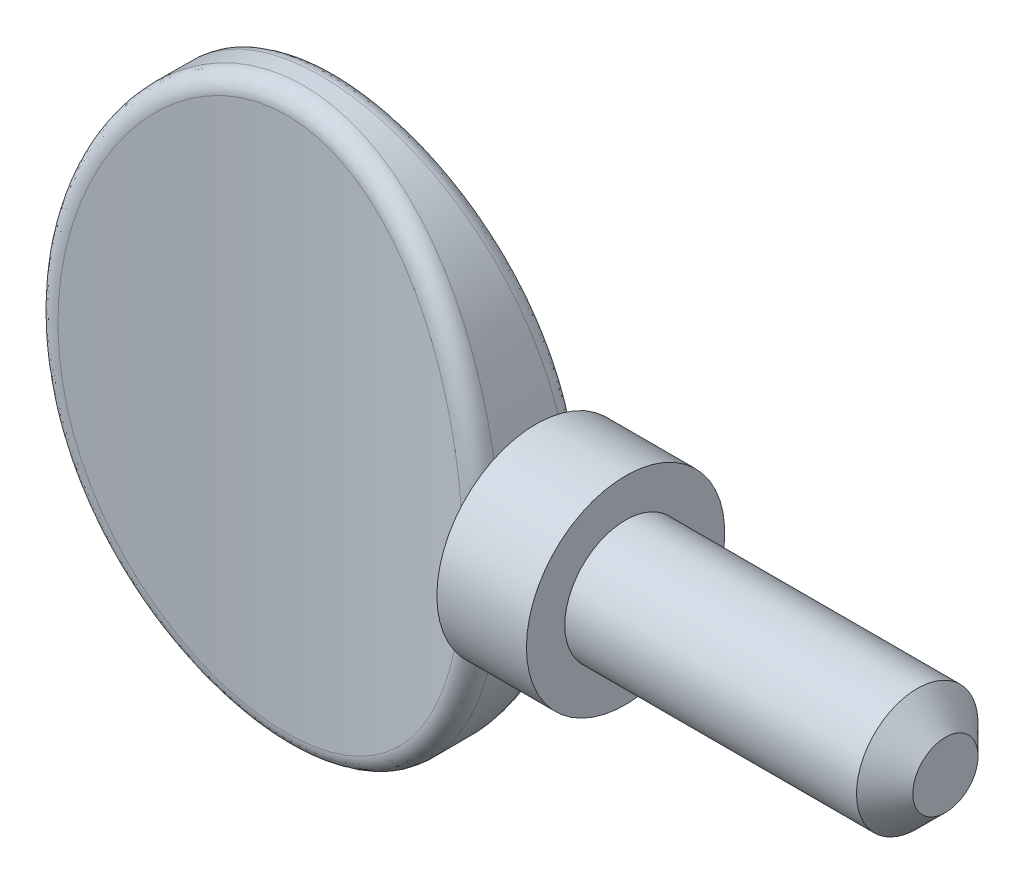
ISO-10303-21;
HEADER;
FILE_DESCRIPTION(('STEP AP214'),'2;1');
FILE_NAME('part.step','',(''),(''),'','','');
FILE_SCHEMA(('AUTOMOTIVE_DESIGN { 1 0 10303 214 1 1 1 1 }'));
ENDSEC;
DATA;
#1=APPLICATION_CONTEXT('core data for automotive mechanical design processes');
#2=APPLICATION_PROTOCOL_DEFINITION('international standard','automotive_design',2000,#1);
#3=PRODUCT_CONTEXT('',#1,'mechanical');
#4=PRODUCT('Part','Part','',(#3));
#5=PRODUCT_RELATED_PRODUCT_CATEGORY('part','',(#4));
#6=PRODUCT_DEFINITION_FORMATION('','',#4);
#7=PRODUCT_DEFINITION_CONTEXT('part definition',#1,'design');
#8=PRODUCT_DEFINITION('design','',#6,#7);
#9=PRODUCT_DEFINITION_SHAPE('','',#8);
#10=(LENGTH_UNIT() NAMED_UNIT(*) SI_UNIT(.MILLI.,.METRE.));
#11=(NAMED_UNIT(*) PLANE_ANGLE_UNIT() SI_UNIT($,.RADIAN.));
#12=(NAMED_UNIT(*) SI_UNIT($,.STERADIAN.) SOLID_ANGLE_UNIT());
#13=UNCERTAINTY_MEASURE_WITH_UNIT(LENGTH_MEASURE(1.E-05),#10,'distance_accuracy_value','');
#14=(GEOMETRIC_REPRESENTATION_CONTEXT(3) GLOBAL_UNCERTAINTY_ASSIGNED_CONTEXT((#13)) GLOBAL_UNIT_ASSIGNED_CONTEXT((#10,
#11,#12)) REPRESENTATION_CONTEXT('',''));
#15=CARTESIAN_POINT('',(0.,0.,0.));
#16=DIRECTION('',(0.,0.,1.));
#17=DIRECTION('',(1.,0.,0.));
#18=AXIS2_PLACEMENT_3D('',#15,#16,#17);
#19=CARTESIAN_POINT('',(0.,0.,2.286));
#20=DIRECTION('',(0.,0.,1.));
#21=DIRECTION('',(0.,1.,0.));
#22=AXIS2_PLACEMENT_3D('',#19,#20,#21);
#23=ELLIPSE('',#22,11.303,8.89);
#24=DIRECTION('',(0.,0.,-1.));
#25=VECTOR('',#24,1.);
#26=SURFACE_OF_LINEAR_EXTRUSION('',#23,#25);
#27=CARTESIAN_POINT('',(8.65241868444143,-2.59563035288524,1.41565744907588));
#28=CARTESIAN_POINT('',(8.64505380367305,-2.63527789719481,1.31316697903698));
#29=CARTESIAN_POINT('',(8.63830595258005,-2.67071705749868,1.20899028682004));
#30=CARTESIAN_POINT('',(8.62627848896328,-2.732857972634,0.997954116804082));
#31=CARTESIAN_POINT('',(8.6209992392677,-2.75955756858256,0.891093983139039));
#32=CARTESIAN_POINT('',(8.61214578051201,-2.8038850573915,0.675401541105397));
#33=CARTESIAN_POINT('',(8.60857205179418,-2.82151039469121,0.566568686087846));
#34=CARTESIAN_POINT('',(8.60328452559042,-2.84746342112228,0.347770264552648));
#35=CARTESIAN_POINT('',(8.60157044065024,-2.85579254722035,0.23780487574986));
#36=CARTESIAN_POINT('',(8.60008413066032,-2.86301911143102,0.018538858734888));
#37=CARTESIAN_POINT('',(8.60029463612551,-2.86200042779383,-0.0907588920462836));
#38=CARTESIAN_POINT('',(8.60260692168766,-2.8507444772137,-0.308858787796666));
#39=CARTESIAN_POINT('',(8.60470870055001,-2.8405072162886,-0.417660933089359));
#40=CARTESIAN_POINT('',(8.61070632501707,-2.810972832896,-0.633744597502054));
#41=CARTESIAN_POINT('',(8.61459849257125,-2.79169428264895,-0.741028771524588));
#42=CARTESIAN_POINT('',(8.62400975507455,-2.74432029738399,-0.953510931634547));
#43=CARTESIAN_POINT('',(8.62952797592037,-2.71622959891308,-1.05871000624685));
#44=CARTESIAN_POINT('',(8.63844994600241,-2.66982167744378,-1.20771767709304));
#45=CARTESIAN_POINT('',(8.64128872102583,-2.65493954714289,-1.25265626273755));
#46=CARTESIAN_POINT('',(8.64720516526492,-2.62361466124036,-1.34191094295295));
#47=CARTESIAN_POINT('',(8.65028255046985,-2.60717375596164,-1.3862277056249));
#48=CARTESIAN_POINT('',(8.65346985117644,-2.58995946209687,-1.43023949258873));
#49=B_SPLINE_CURVE_WITH_KNOTS('',3,(#27,#28,#29,#30,#31,#32,#33,#34,#35,#36,#37,#38,#39,#40,#41,
#42,#43,#44,#45,#46,#47,#48),.UNSPECIFIED.,.F.,.F.,(4,2,2,2,2,2,2,2,2,2,4),(0.,
0.330340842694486,0.660763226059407,0.991278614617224,1.3217429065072,1.64924484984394,
1.97674657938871,2.30357849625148,2.63023504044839,2.772481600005,2.91456137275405),.UNSPECIFIED.);
#50=CARTESIAN_POINT('',(8.64686129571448,-2.62539678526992,1.33619092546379));
#51=VERTEX_POINT('',#50);
#52=CARTESIAN_POINT('',(8.64686129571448,-2.62539678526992,-1.33619092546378));
#53=VERTEX_POINT('',#52);
#54=EDGE_CURVE('E95',#51,#53,#49,.T.);
#55=ORIENTED_EDGE('',*,*,#54,.F.);
#56=CARTESIAN_POINT('',(7.82629564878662,2.4351042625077,1.99569619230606));
#57=CARTESIAN_POINT('',(8.65245132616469,2.59576258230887,2.20582536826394));
#58=CARTESIAN_POINT('',(8.65956685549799,2.55680519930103,1.33926304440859));
#59=CARTESIAN_POINT('',(7.94743912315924,1.75770532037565,2.02649942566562));
#60=CARTESIAN_POINT('',(8.78692406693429,1.87112905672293,2.24349586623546));
#61=CARTESIAN_POINT('',(8.78960914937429,1.8448432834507,1.37072341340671));
#62=CARTESIAN_POINT('',(8.01716971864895,1.07004055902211,2.0448717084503));
#63=CARTESIAN_POINT('',(8.86351312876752,1.1404733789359,2.26573738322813));
#64=CARTESIAN_POINT('',(8.86432478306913,1.12299912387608,1.38948763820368));
#65=CARTESIAN_POINT('',(8.0547289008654,-0.309351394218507,2.05469325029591));
#66=CARTESIAN_POINT('',(8.90506846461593,-0.330332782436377,2.27771295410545));
#67=CARTESIAN_POINT('',(8.90458477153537,-0.324674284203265,1.399518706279));
#68=CARTESIAN_POINT('',(8.02243825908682,-1.00108239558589,2.04611100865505));
#69=CARTESIAN_POINT('',(8.86961883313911,-1.06541121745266,2.26732632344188));
#70=CARTESIAN_POINT('',(8.87000139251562,-1.05050720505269,1.39075337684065));
#71=CARTESIAN_POINT('',(7.89401839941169,-2.05341820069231,2.01297572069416));
#72=CARTESIAN_POINT('',(8.7273712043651,-2.18848798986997,2.22688533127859));
#73=CARTESIAN_POINT('',(8.7322517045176,-2.15566998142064,1.35691120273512));
#74=CARTESIAN_POINT('',(7.83428558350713,-2.41932216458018,1.99763575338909));
#75=CARTESIAN_POINT('',(8.66147254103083,-2.57804176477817,2.20823888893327));
#76=CARTESIAN_POINT('',(8.66816384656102,-2.54012241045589,1.34124398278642));
#77=CARTESIAN_POINT('',(7.68487396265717,-3.14447608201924,1.95997275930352));
#78=CARTESIAN_POINT('',(8.49634767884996,-3.35051128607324,2.16238668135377));
#79=CARTESIAN_POINT('',(8.50770464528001,-3.302633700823,1.30277751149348));
#80=CARTESIAN_POINT('',(7.59519051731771,-3.50372499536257,1.93764865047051));
#81=CARTESIAN_POINT('',(8.39743269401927,-3.73273694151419,2.13526405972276));
#82=CARTESIAN_POINT('',(8.41132829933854,-3.68069156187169,1.27997715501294));
#83=CARTESIAN_POINT('',(7.38556781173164,-4.21216799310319,1.88675959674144));
#84=CARTESIAN_POINT('',(8.16589203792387,-4.48682518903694,2.07336294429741));
#85=CARTESIAN_POINT('',(8.18576943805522,-4.42707064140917,1.22800246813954));
#86=CARTESIAN_POINT('',(7.26565071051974,-4.56136923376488,1.8581992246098));
#87=CARTESIAN_POINT('',(8.0337174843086,-4.85809981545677,2.03869510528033));
#88=CARTESIAN_POINT('',(8.05661094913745,-4.79539877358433,1.19883280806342));
#89=CARTESIAN_POINT('',(6.995124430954,-5.2464697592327,1.79585403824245));
#90=CARTESIAN_POINT('',(7.73510821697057,-5.5867008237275,1.96294144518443));
#91=CARTESIAN_POINT('',(7.76473855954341,-5.51911593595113,1.13515759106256));
#92=CARTESIAN_POINT('',(6.84452615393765,-5.58237371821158,1.76207108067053));
#93=CARTESIAN_POINT('',(7.56920233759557,-5.94356882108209,1.92197039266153));
#94=CARTESIAN_POINT('',(7.60203657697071,-5.87450950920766,1.10065393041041));
#95=CARTESIAN_POINT('',(6.43324199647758,-6.39240336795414,1.67357133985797));
#96=CARTESIAN_POINT('',(7.1165122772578,-6.80243787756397,1.81477728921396));
#97=CARTESIAN_POINT('',(7.15675137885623,-6.73320066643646,1.01026619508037));
#98=CARTESIAN_POINT('',(6.15417610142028,-6.85676635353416,1.61651047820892));
#99=CARTESIAN_POINT('',(6.80972916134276,-7.29531731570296,1.74570436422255));
#100=CARTESIAN_POINT('',(6.85386362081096,-7.22695535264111,0.951988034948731));
#101=CARTESIAN_POINT('',(5.52696453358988,-7.73305703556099,1.49913786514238));
#102=CARTESIAN_POINT('',(6.11796499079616,-8.22578037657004,1.60333969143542));
#103=CARTESIAN_POINT('',(6.17012522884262,-8.16227422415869,0.832111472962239));
#104=CARTESIAN_POINT('',(5.1789299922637,-8.14506735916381,1.43883145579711));
#105=CARTESIAN_POINT('',(5.73502064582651,-8.66343687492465,1.53025899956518));
#106=CARTESIAN_POINT('',(5.78939998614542,-8.60392057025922,0.770518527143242));
#107=CARTESIAN_POINT('',(4.49456535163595,-8.81832678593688,1.33426170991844));
#108=CARTESIAN_POINT('',(4.97849314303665,-9.37945459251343,1.4032069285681));
#109=CARTESIAN_POINT('',(5.0366311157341,-9.32899377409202,0.663717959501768));
#110=CARTESIAN_POINT('',(4.17119435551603,-9.09305461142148,1.28929359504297));
#111=CARTESIAN_POINT('',(4.62171828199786,-9.67163474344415,1.34859286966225));
#112=CARTESIAN_POINT('',(4.67963160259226,-9.62615608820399,0.617790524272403));
#113=CARTESIAN_POINT('',(3.65633336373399,-9.46244525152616,1.22675958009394));
#114=CARTESIAN_POINT('',(4.05119027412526,-10.0652330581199,1.27244557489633));
#115=CARTESIAN_POINT('',(4.10859190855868,-10.0272910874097,0.553922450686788));
#116=CARTESIAN_POINT('',(3.47966977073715,-9.5784960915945,1.2067276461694));
#117=CARTESIAN_POINT('',(3.85593810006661,-10.1886210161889,1.24810451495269));
#118=CARTESIAN_POINT('',(3.91223716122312,-10.1536091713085,0.533463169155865));
#119=CARTESIAN_POINT('',(3.11708209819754,-9.79472651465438,1.16885648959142));
#120=CARTESIAN_POINT('',(3.45504248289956,-10.4184405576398,1.20209344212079));
#121=CARTESIAN_POINT('',(3.50833839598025,-10.3894449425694,0.494784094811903));
#122=CARTESIAN_POINT('',(2.93116240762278,-9.89491352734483,1.15101624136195));
#123=CARTESIAN_POINT('',(3.2493632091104,-10.5250344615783,1.18039540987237));
#124=CARTESIAN_POINT('',(3.30079967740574,-10.4989704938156,0.476563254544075));
#125=CARTESIAN_POINT('',(2.54905941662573,-10.0787208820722,1.11790469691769));
#126=CARTESIAN_POINT('',(2.82653251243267,-10.7204996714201,1.14013561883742));
#127=CARTESIAN_POINT('',(2.87336447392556,-10.7002891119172,0.442745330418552));
#128=CARTESIAN_POINT('',(2.35279103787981,-10.162162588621,1.10266133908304));
#129=CARTESIAN_POINT('',(2.60916890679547,-10.8093536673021,1.12157484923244));
#130=CARTESIAN_POINT('',(2.65336386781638,-10.7918907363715,0.427176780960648));
#131=CARTESIAN_POINT('',(1.95321853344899,-10.3095327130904,1.0755046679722));
#132=CARTESIAN_POINT('',(2.16659574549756,-10.9661742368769,1.08852563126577));
#133=CARTESIAN_POINT('',(2.20463537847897,-10.9539332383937,0.399440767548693));
#134=CARTESIAN_POINT('',(1.74991833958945,-10.3734718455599,1.06358952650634));
#135=CARTESIAN_POINT('',(1.94121514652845,-11.0343149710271,1.07400206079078));
#136=CARTESIAN_POINT('',(1.97591236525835,-11.0243857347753,0.387271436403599));
#137=CARTESIAN_POINT('',(1.33807057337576,-10.4804542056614,1.04353897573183));
#138=CARTESIAN_POINT('',(1.48468245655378,-11.1482227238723,1.04958182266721));
#139=CARTESIAN_POINT('',(1.51188091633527,-11.1424052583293,0.366793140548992));
#140=CARTESIAN_POINT('',(1.12952697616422,-10.5235127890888,1.03540078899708));
#141=CARTESIAN_POINT('',(1.2532927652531,-11.1941423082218,1.03965311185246));
#142=CARTESIAN_POINT('',(1.27657745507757,-11.1899891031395,0.358481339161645));
#143=CARTESIAN_POINT('',(0.709126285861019,-10.5877622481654,1.02322405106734));
#144=CARTESIAN_POINT('',(0.787001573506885,-11.2625799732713,1.02481403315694));
#145=CARTESIAN_POINT('',(0.8017907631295,-11.2610341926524,0.346044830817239));
#146=CARTESIAN_POINT('',(0.49726981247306,-10.6089571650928,1.01918474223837));
#147=CARTESIAN_POINT('',(0.55180519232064,-11.2851925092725,1.0198833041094));
#148=CARTESIAN_POINT('',(0.562308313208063,-11.2844998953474,0.341919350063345));
#149=CARTESIAN_POINT('',(0.105050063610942,-10.627432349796,1.01566371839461));
#150=CARTESIAN_POINT('',(0.116614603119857,-11.3048795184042,1.01559044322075));
#151=CARTESIAN_POINT('',(0.118812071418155,-11.304954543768,0.338323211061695));
#152=CARTESIAN_POINT('',(-0.0751715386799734,-10.6278758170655,1.01557916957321));
#153=CARTESIAN_POINT('',(-0.0834564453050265,-11.3053519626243,1.01548738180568));
#154=CARTESIAN_POINT('',(-0.0850214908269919,-11.3054455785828,0.338236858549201));
#155=CARTESIAN_POINT('',(-0.434937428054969,-10.6127090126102,1.01846977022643));
#156=CARTESIAN_POINT('',(-0.482622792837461,-11.2891920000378,1.01901126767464));
#157=CARTESIAN_POINT('',(-0.491831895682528,-11.2886536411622,0.341189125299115));
#158=CARTESIAN_POINT('',(-0.614481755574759,-10.5970997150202,1.02144473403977));
#159=CARTESIAN_POINT('',(-0.681915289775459,-11.2725446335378,1.0226414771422));
#160=CARTESIAN_POINT('',(-0.694808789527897,-11.2713717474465,0.34422755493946));
#161=CARTESIAN_POINT('',(-0.971475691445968,-10.5501136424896,1.03036356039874));
#162=CARTESIAN_POINT('',(-1.0779135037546,-11.2224918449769,1.03351143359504));
#163=CARTESIAN_POINT('',(-1.0981231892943,-11.2193981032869,0.353336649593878));
#164=CARTESIAN_POINT('',(-1.14892554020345,-10.5187386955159,1.03630707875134));
#165=CARTESIAN_POINT('',(-1.27480360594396,-11.1890405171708,1.04076111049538));
#166=CARTESIAN_POINT('',(-1.29846099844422,-11.1847083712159,0.359406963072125));
#167=CARTESIAN_POINT('',(-1.50046734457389,-10.4407724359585,1.05098693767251));
#168=CARTESIAN_POINT('',(-1.66458038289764,-11.1060123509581,1.05864455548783));
#169=CARTESIAN_POINT('',(-1.69492269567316,-11.0986163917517,0.374399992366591));
#170=CARTESIAN_POINT('',(-1.6745592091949,-10.3941807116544,1.05972335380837));
#171=CARTESIAN_POINT('',(-1.85762658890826,-11.056361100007,1.06929413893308));
#172=CARTESIAN_POINT('',(-1.89104646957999,-11.047213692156,0.383322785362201));
#173=CARTESIAN_POINT('',(-2.01159554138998,-10.2886238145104,1.07935663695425));
#174=CARTESIAN_POINT('',(-2.23106714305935,-10.9440082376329,1.09319591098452));
#175=CARTESIAN_POINT('',(-2.27021161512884,-10.9309431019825,0.403374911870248));
#176=CARTESIAN_POINT('',(-2.17471076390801,-10.2302066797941,1.0901569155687));
#177=CARTESIAN_POINT('',(-2.4117997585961,-10.8817955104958,1.10635018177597));
#178=CARTESIAN_POINT('',(-2.45346562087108,-10.8666726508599,0.414405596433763));
#179=CARTESIAN_POINT('',(-2.4959633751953,-10.1008201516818,1.11384924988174));
#180=CARTESIAN_POINT('',(-2.76753136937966,-10.744137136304,1.13517612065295));
#181=CARTESIAN_POINT('',(-2.81382794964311,-10.7245661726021,0.438603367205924));
#182=CARTESIAN_POINT('',(-2.6540991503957,-10.0298467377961,1.12674197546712));
#183=CARTESIAN_POINT('',(-2.94261127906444,-10.6685976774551,1.15086640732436));
#184=CARTESIAN_POINT('',(-2.99093428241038,-10.6467258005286,0.451771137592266));
#185=CARTESIAN_POINT('',(-3.11989632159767,-9.79942559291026,1.16812424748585));
#186=CARTESIAN_POINT('',(-3.45909560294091,-10.4230523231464,1.20128501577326));
#187=CARTESIAN_POINT('',(-3.51173172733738,-10.394478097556,0.494036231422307));
#188=CARTESIAN_POINT('',(-3.41911154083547,-9.62242439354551,1.19932790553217));
#189=CARTESIAN_POINT('',(-3.79004687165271,-10.2345494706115,1.23926399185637));
#190=CARTESIAN_POINT('',(-3.84508579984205,-10.20128606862,0.52590556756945));
#191=CARTESIAN_POINT('',(-4.09904643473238,-9.15457953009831,1.27920788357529));
#192=CARTESIAN_POINT('',(-4.54276316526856,-9.7366002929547,1.33643019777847));
#193=CARTESIAN_POINT('',(-4.59999386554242,-9.69271674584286,0.607489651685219));
#194=CARTESIAN_POINT('',(-4.4677733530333,-8.84600074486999,1.33002831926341));
#195=CARTESIAN_POINT('',(-4.94952770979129,-9.40827652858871,1.39816929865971));
#196=CARTESIAN_POINT('',(-5.00720170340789,-9.35876546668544,0.659394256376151));
#197=CARTESIAN_POINT('',(-5.1506512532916,-8.17151649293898,1.43465606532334));
#198=CARTESIAN_POINT('',(-5.70311367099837,-8.69214633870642,1.52508390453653));
#199=CARTESIAN_POINT('',(-5.75825220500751,-8.63243872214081,0.766254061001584));
#200=CARTESIAN_POINT('',(-5.46469809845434,-7.80550411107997,1.48846882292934));
#201=CARTESIAN_POINT('',(-6.04883115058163,-8.30338280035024,1.59030661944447));
#202=CARTESIAN_POINT('',(-6.10197403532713,-8.23995436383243,0.821214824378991));
#203=CARTESIAN_POINT('',(-6.11532335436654,-6.92506403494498,1.6082879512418));
#204=CARTESIAN_POINT('',(-6.76780893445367,-7.36679603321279,1.7359003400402));
#205=CARTESIAN_POINT('',(-6.81177427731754,-7.29951289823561,0.943590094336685));
#206=CARTESIAN_POINT('',(-6.43476934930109,-6.39735552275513,1.67362664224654));
#207=CARTESIAN_POINT('',(-7.11866978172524,-6.80670608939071,1.81495566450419));
#208=CARTESIAN_POINT('',(-7.15847428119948,-6.73831516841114,1.01032267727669));
#209=CARTESIAN_POINT('',(-6.98586982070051,-5.29504721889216,1.79279155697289));
#210=CARTESIAN_POINT('',(-7.72672939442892,-5.63515267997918,1.95964859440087));
#211=CARTESIAN_POINT('',(-7.75498793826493,-5.57007516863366,1.13202977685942));
#212=CARTESIAN_POINT('',(-7.21743550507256,-4.72040071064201,1.84660611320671));
#213=CARTESIAN_POINT('',(-7.98107986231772,-5.02517153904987,2.02476167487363));
#214=CARTESIAN_POINT('',(-8.00470360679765,-4.96298727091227,1.18699237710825));
#215=CARTESIAN_POINT('',(-7.59788704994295,-3.53286241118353,1.93787390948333));
#216=CARTESIAN_POINT('',(-8.40127783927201,-3.76125290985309,2.13576419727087));
#217=CARTESIAN_POINT('',(-8.41432758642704,-3.71108875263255,1.28020721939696));
#218=CARTESIAN_POINT('',(-7.74551320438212,-2.91953395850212,1.97507615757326));
#219=CARTESIAN_POINT('',(-8.56353360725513,-3.10968614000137,2.18081781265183));
#220=CARTESIAN_POINT('',(-8.572867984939,-3.06585606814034,1.31820311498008));
#221=CARTESIAN_POINT('',(-7.95444111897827,-1.67779030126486,2.02838222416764));
#222=CARTESIAN_POINT('',(-8.79452477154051,-1.78651139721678,2.24575202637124));
#223=CARTESIAN_POINT('',(-8.79710310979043,-1.76097068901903,1.37264637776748));
#224=CARTESIAN_POINT('',(-8.01589074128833,-1.04940282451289,2.04452217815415));
#225=CARTESIAN_POINT('',(-8.86213168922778,-1.11847428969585,2.26532120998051));
#226=CARTESIAN_POINT('',(-8.86295686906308,-1.10134467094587,1.38913065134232));
#227=CARTESIAN_POINT('',(-8.04339962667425,-0.134428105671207,2.05173737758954));
#228=CARTESIAN_POINT('',(-8.89250870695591,-0.143244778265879,2.27410147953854));
#229=CARTESIAN_POINT('',(-8.89243947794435,-0.141070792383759,1.39649977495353));
#230=CARTESIAN_POINT('',(-8.04322422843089,0.151433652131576,2.05168672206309));
#231=CARTESIAN_POINT('',(-8.89232438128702,0.161377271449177,2.2740424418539));
#232=CARTESIAN_POINT('',(-8.8922524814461,0.158917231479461,1.39644803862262));
#233=CARTESIAN_POINT('',(-8.02535656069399,0.722706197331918,2.04701032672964));
#234=CARTESIAN_POINT('',(-8.87256700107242,0.770474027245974,2.26834414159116));
#235=CARTESIAN_POINT('',(-8.87310070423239,0.758474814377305,1.39167188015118));
#236=CARTESIAN_POINT('',(-8.00765727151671,1.00811675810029,2.04238275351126));
#237=CARTESIAN_POINT('',(-8.85300951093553,1.07458955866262,2.26270936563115));
#238=CARTESIAN_POINT('',(-8.85412839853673,1.05804415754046,1.3869455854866));
#239=CARTESIAN_POINT('',(-7.947886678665,1.6500558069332,2.02685880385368));
#240=CARTESIAN_POINT('',(-8.78692419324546,1.75875334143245,2.24379627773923));
#241=CARTESIAN_POINT('',(-8.79003704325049,1.73201243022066,1.37109045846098));
#242=CARTESIAN_POINT('',(-7.90073256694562,2.00606858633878,2.01465999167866));
#243=CARTESIAN_POINT('',(-8.73487578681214,2.1378622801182,2.22895949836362));
#244=CARTESIAN_POINT('',(-8.73946402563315,2.10591711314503,1.35863140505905));
#245=CARTESIAN_POINT('',(-7.77848949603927,2.71274841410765,1.98351195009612));
#246=CARTESIAN_POINT('',(-8.5997385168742,2.89083812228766,2.19102428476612));
#247=CARTESIAN_POINT('',(-8.6082550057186,2.84858479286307,1.3268188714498));
#248=CARTESIAN_POINT('',(-7.70339994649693,3.063415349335,1.9645625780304));
#249=CARTESIAN_POINT('',(-8.51689426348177,3.26405432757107,2.16799271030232));
#250=CARTESIAN_POINT('',(-8.52761836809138,3.21734768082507,1.30746524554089));
#251=CARTESIAN_POINT('',(-7.52482874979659,3.75734261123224,1.92045005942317));
#252=CARTESIAN_POINT('',(-8.3196020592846,4.00293869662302,2.11431336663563));
#253=CARTESIAN_POINT('',(-8.33564394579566,3.94777946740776,1.26241165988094));
#254=CARTESIAN_POINT('',(-7.42130346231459,4.10059067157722,1.89527736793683));
#255=CARTESIAN_POINT('',(-8.20545267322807,4.36801638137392,2.0837427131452));
#256=CARTESIAN_POINT('',(-8.22425897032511,4.30943653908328,1.23670195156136));
#257=CARTESIAN_POINT('',(-7.18557888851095,4.77601163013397,1.83956259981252));
#258=CARTESIAN_POINT('',(-7.94517850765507,5.08660176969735,2.01601312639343));
#259=CARTESIAN_POINT('',(-7.97026371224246,5.02200340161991,1.17979860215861));
#260=CARTESIAN_POINT('',(-7.05338947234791,5.10818829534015,1.80902237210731));
#261=CARTESIAN_POINT('',(-7.79950129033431,5.43963428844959,1.97895746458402));
#262=CARTESIAN_POINT('',(-7.8276641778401,5.37291684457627,1.14860684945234));
#263=CARTESIAN_POINT('',(-6.67495246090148,5.94632514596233,1.72466643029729));
#264=CARTESIAN_POINT('',(-7.38297359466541,6.32842399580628,1.8767643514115));
#265=CARTESIAN_POINT('',(-7.4186740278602,6.25981775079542,1.06245131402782));
#266=CARTESIAN_POINT('',(-6.40690462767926,6.44195824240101,1.66758899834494));
#267=CARTESIAN_POINT('',(-7.08838989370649,6.8544708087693,1.80768456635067));
#268=CARTESIAN_POINT('',(-7.12833321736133,6.78575428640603,1.00415623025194));
#269=CARTESIAN_POINT('',(-5.79654461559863,7.38178409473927,1.54807423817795));
#270=CARTESIAN_POINT('',(-6.41517877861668,7.85259495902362,1.66268974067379));
#271=CARTESIAN_POINT('',(-6.46441231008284,7.78670698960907,0.882091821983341));
#272=CARTESIAN_POINT('',(-5.45436166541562,7.82606432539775,1.48564634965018));
#273=CARTESIAN_POINT('',(-6.03887887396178,8.32439730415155,1.58707563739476));
#274=CARTESIAN_POINT('',(-6.09097702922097,8.26180964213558,0.81833213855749));
#275=CARTESIAN_POINT('',(-4.77789167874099,8.55448470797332,1.37612062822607));
#276=CARTESIAN_POINT('',(-5.29119543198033,9.09910698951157,1.45400801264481));
#277=CARTESIAN_POINT('',(-5.34869298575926,9.04439141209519,0.70646986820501));
#278=CARTESIAN_POINT('',(-4.45799420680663,8.85245688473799,1.32863499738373));
#279=CARTESIAN_POINT('',(-4.93851328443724,9.41585809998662,1.39637707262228));
#280=CARTESIAN_POINT('',(-4.99642235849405,9.36587548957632,0.65797121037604));
#281=CARTESIAN_POINT('',(-3.77461012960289,9.39190551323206,1.23929408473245));
#282=CARTESIAN_POINT('',(-4.18378611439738,9.98880971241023,1.2879446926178));
#283=CARTESIAN_POINT('',(-4.24030383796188,9.95027102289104,0.566724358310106));
#284=CARTESIAN_POINT('',(-3.41117328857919,9.63344555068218,1.19743248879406));
#285=CARTESIAN_POINT('',(-3.78213052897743,10.2460992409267,1.237002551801));
#286=CARTESIAN_POINT('',(-3.83651479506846,10.2132483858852,0.523969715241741));
#287=CARTESIAN_POINT('',(-2.7071131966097,10.0130852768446,1.12997552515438));
#288=CARTESIAN_POINT('',(-3.00265612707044,10.6500345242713,1.15495053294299));
#289=CARTESIAN_POINT('',(-3.05059237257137,10.6281650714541,0.455073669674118));
#290=CARTESIAN_POINT('',(-2.37204630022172,10.1615243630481,1.10285226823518));
#291=CARTESIAN_POINT('',(-2.63139042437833,10.8083853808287,1.12186903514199));
#292=CARTESIAN_POINT('',(-2.67521894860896,10.7911098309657,0.427371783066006));
#293=CARTESIAN_POINT('',(-1.85473120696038,10.3404490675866,1.06974582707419));
#294=CARTESIAN_POINT('',(-2.05733540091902,10.9991414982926,1.08150227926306));
#295=CARTESIAN_POINT('',(-2.09383679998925,10.9879949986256,0.393559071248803));
#296=CARTESIAN_POINT('',(-1.67979337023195,10.3928095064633,1.05997187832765));
#297=CARTESIAN_POINT('',(-1.86339026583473,11.0549303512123,1.06959065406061));
#298=CARTESIAN_POINT('',(-1.89693593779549,11.045710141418,0.383576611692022));
#299=CARTESIAN_POINT('',(-1.32608818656,10.4821521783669,1.04321230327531));
#300=CARTESIAN_POINT('',(-1.47128411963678,11.1500600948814,1.04917741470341));
#301=CARTESIAN_POINT('',(-1.49833774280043,11.1442889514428,0.366459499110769));
#302=CARTESIAN_POINT('',(-1.14732240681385,10.5191405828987,1.03622555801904));
#303=CARTESIAN_POINT('',(-1.27297000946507,11.1894916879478,1.04065670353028));
#304=CARTESIAN_POINT('',(-1.29664236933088,11.1851593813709,0.359323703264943));
#305=CARTESIAN_POINT('',(-0.786475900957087,10.5772111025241,1.02522674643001));
#306=CARTESIAN_POINT('',(-0.872750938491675,11.2513466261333,1.0272534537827));
#307=CARTESIAN_POINT('',(-0.8891721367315,11.2493631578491,0.348090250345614));
#308=CARTESIAN_POINT('',(-0.604384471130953,10.5982263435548,1.02122718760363));
#309=CARTESIAN_POINT('',(-0.670646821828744,11.2737587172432,1.02237324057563));
#310=CARTESIAN_POINT('',(-0.683383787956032,11.2726227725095,0.344005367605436));
#311=CARTESIAN_POINT('',(-0.239046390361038,10.6237097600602,1.01637444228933));
#312=CARTESIAN_POINT('',(-0.265317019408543,11.3009091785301,1.01645776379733));
#313=CARTESIAN_POINT('',(-0.270347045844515,11.3008314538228,0.339049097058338));
#314=CARTESIAN_POINT('',(-0.0557997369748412,10.6281779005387,1.01552126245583));
#315=CARTESIAN_POINT('',(-0.0618866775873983,11.3056751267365,1.01541649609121));
#316=CARTESIAN_POINT('',(-0.0630986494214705,11.3057804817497,0.338177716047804));
#317=CARTESIAN_POINT('',(0.310342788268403,10.6204795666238,1.01698891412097));
#318=CARTESIAN_POINT('',(0.344362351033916,11.2974728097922,1.01720566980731));
#319=CARTESIAN_POINT('',(0.350954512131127,11.2972566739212,0.339676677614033));
#320=CARTESIAN_POINT('',(0.493238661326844,10.6083131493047,1.0193097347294));
#321=CARTESIAN_POINT('',(0.547389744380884,11.2844961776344,1.02003793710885));
#322=CARTESIAN_POINT('',(0.557759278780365,11.2837839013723,0.342047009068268));
#323=CARTESIAN_POINT('',(0.857193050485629,10.5675786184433,1.02705146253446));
#324=CARTESIAN_POINT('',(0.951137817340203,11.2411005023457,1.02947400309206));
#325=CARTESIAN_POINT('',(0.969049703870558,11.2387130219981,0.349953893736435));
#326=CARTESIAN_POINT('',(1.03825162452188,10.5390110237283,1.03247227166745));
#327=CARTESIAN_POINT('',(1.15205642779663,11.2106386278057,1.03608708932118));
#328=CARTESIAN_POINT('',(1.17353543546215,11.2071154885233,0.355490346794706));
#329=CARTESIAN_POINT('',(1.38577241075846,10.4683102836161,1.04581044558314));
#330=CARTESIAN_POINT('',(1.53738746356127,11.1353476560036,1.05233647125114));
#331=CARTESIAN_POINT('',(1.56562555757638,11.1290138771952,0.36911306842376));
#332=CARTESIAN_POINT('',(1.55243251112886,10.4271514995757,1.05354783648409));
#333=CARTESIAN_POINT('',(1.72221209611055,11.0914846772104,1.06176887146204));
#334=CARTESIAN_POINT('',(1.75347855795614,11.0835813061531,0.377015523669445));
#335=CARTESIAN_POINT('',(1.88194456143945,10.3315323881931,1.07139376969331));
#336=CARTESIAN_POINT('',(2.08740434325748,10.9896901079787,1.08349994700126));
#337=CARTESIAN_POINT('',(2.12443081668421,10.9781855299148,0.395242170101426));
#338=CARTESIAN_POINT('',(2.0447952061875,10.2770675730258,1.08150311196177));
#339=CARTESIAN_POINT('',(2.26788778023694,10.9316775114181,1.09581547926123));
#340=CARTESIAN_POINT('',(2.30752844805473,10.9182174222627,0.405567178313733));
#341=CARTESIAN_POINT('',(2.52615676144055,10.0948432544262,1.11502540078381));
#342=CARTESIAN_POINT('',(2.80192013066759,10.7374389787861,1.13667911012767));
#343=CARTESIAN_POINT('',(2.84792805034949,10.7179160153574,0.439804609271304));
#344=CARTESIAN_POINT('',(2.83775186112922,9.94819639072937,1.14164376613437));
#345=CARTESIAN_POINT('',(3.14702031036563,10.5810992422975,1.16912176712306));
#346=CARTESIAN_POINT('',(3.19664674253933,10.5571217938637,0.466990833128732));
#347=CARTESIAN_POINT('',(3.46147687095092,9.59774159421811,1.20356654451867));
#348=CARTESIAN_POINT('',(3.83708974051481,10.2084377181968,1.24439518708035));
#349=CARTESIAN_POINT('',(3.89231625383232,10.1744153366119,0.530234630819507));
#350=CARTESIAN_POINT('',(3.77151791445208,9.3902081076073,1.23940741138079));
#351=CARTESIAN_POINT('',(4.17970555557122,9.98753738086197,1.28798248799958));
#352=CARTESIAN_POINT('',(4.23673354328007,9.94854700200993,0.56684010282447));
#353=CARTESIAN_POINT('',(4.35991988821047,8.93336469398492,1.3153767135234));
#354=CARTESIAN_POINT('',(4.82954880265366,9.50230750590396,1.38018944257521));
#355=CARTESIAN_POINT('',(4.88803612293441,9.45342711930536,0.644430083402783));
#356=CARTESIAN_POINT('',(4.63825599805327,8.68402240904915,1.3555084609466));
#357=CARTESIAN_POINT('',(5.1365679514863,9.23728381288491,1.42890183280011));
#358=CARTESIAN_POINT('',(5.19489202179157,9.18414197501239,0.685417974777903));
#359=CARTESIAN_POINT('',(5.2883525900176,8.02265329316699,1.45704370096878));
#360=CARTESIAN_POINT('',(5.8558547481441,8.53323619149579,1.55237909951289));
#361=CARTESIAN_POINT('',(5.90931964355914,8.47252416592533,0.789119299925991));
#362=CARTESIAN_POINT('',(5.64019381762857,7.59026791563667,1.51934813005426));
#363=CARTESIAN_POINT('',(6.24288672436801,8.07397250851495,1.62786734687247));
#364=CARTESIAN_POINT('',(6.29382777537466,8.00948569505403,0.852752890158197));
#365=CARTESIAN_POINT('',(6.27033111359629,6.67225546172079,1.63966575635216));
#366=CARTESIAN_POINT('',(6.93790446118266,7.09909556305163,1.77382186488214));
#367=CARTESIAN_POINT('',(6.98009678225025,7.03057005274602,0.975637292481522));
#368=CARTESIAN_POINT('',(6.54850581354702,6.18654236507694,1.69767175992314));
#369=CARTESIAN_POINT('',(7.2436171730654,6.58356877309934,1.84402554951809));
#370=CARTESIAN_POINT('',(7.28172113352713,6.51460760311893,1.03488075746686));
#371=CARTESIAN_POINT('',(7.03636802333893,5.17052156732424,1.80448690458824));
#372=CARTESIAN_POINT('',(7.7819565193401,5.50356359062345,1.97373871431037));
#373=CARTESIAN_POINT('',(7.80945284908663,5.43850602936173,1.14397462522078));
#374=CARTESIAN_POINT('',(7.24495455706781,4.63964991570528,1.85314346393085));
#375=CARTESIAN_POINT('',(8.01126147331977,4.93984669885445,2.03265655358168));
#376=CARTESIAN_POINT('',(8.03434739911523,4.87781622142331,1.19366919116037));
#377=CARTESIAN_POINT('',(7.5896007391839,3.55324278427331,1.93595435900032));
#378=CARTESIAN_POINT('',(8.39188677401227,3.78362130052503,2.13336693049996));
#379=CARTESIAN_POINT('',(8.40539047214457,3.7326204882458,1.27824671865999));
#380=CARTESIAN_POINT('',(7.72568060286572,2.99771422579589,1.97011273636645));
#381=CARTESIAN_POINT('',(8.54157946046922,3.19321802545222,2.17476629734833));
#382=CARTESIAN_POINT('',(8.55156094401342,3.14812125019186,1.31313380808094));
#383=CARTESIAN_POINT('',(7.82629564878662,2.4351042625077,1.99569619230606));
#384=CARTESIAN_POINT('',(8.65245132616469,2.59576258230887,2.20582536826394));
#385=CARTESIAN_POINT('',(8.65956685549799,2.55680519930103,1.33926304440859));
#386=(BOUNDED_SURFACE() B_SPLINE_SURFACE(3,2,((#56,#57,#58),(#59,#60,#61),(#62,#63,#64),(#65,
#66,#67),(#68,#69,#70),(#71,#72,#73),(#74,#75,#76),(#77,#78,#79),(#80,#81,#82),(#83,#84,#85),
(#86,#87,#88),(#89,#90,#91),(#92,#93,#94),(#95,#96,#97),(#98,#99,#100),(#101,#102,#103),(#104,
#105,#106),(#107,#108,#109),(#110,#111,#112),(#113,#114,#115),(#116,#117,#118),(#119,#120,#121),
(#122,#123,#124),(#125,#126,#127),(#128,#129,#130),(#131,#132,#133),(#134,#135,#136),(#137,#138,
#139),(#140,#141,#142),(#143,#144,#145),(#146,#147,#148),(#149,#150,#151),(#152,#153,#154),
(#155,#156,#157),(#158,#159,#160),(#161,#162,#163),(#164,#165,#166),(#167,#168,#169),(#170,#171,
#172),(#173,#174,#175),(#176,#177,#178),(#179,#180,#181),(#182,#183,#184),(#185,#186,#187),
(#188,#189,#190),(#191,#192,#193),(#194,#195,#196),(#197,#198,#199),(#200,#201,#202),(#203,#204,
#205),(#206,#207,#208),(#209,#210,#211),(#212,#213,#214),(#215,#216,#217),(#218,#219,#220),
(#221,#222,#223),(#224,#225,#226),(#227,#228,#229),(#230,#231,#232),(#233,#234,#235),(#236,#237,
#238),(#239,#240,#241),(#242,#243,#244),(#245,#246,#247),(#248,#249,#250),(#251,#252,#253),
(#254,#255,#256),(#257,#258,#259),(#260,#261,#262),(#263,#264,#265),(#266,#267,#268),(#269,#270,
#271),(#272,#273,#274),(#275,#276,#277),(#278,#279,#280),(#281,#282,#283),(#284,#285,#286),
(#287,#288,#289),(#290,#291,#292),(#293,#294,#295),(#296,#297,#298),(#299,#300,#301),(#302,#303,
#304),(#305,#306,#307),(#308,#309,#310),(#311,#312,#313),(#314,#315,#316),(#317,#318,#319),
(#320,#321,#322),(#323,#324,#325),(#326,#327,#328),(#329,#330,#331),(#332,#333,#334),(#335,#336,
#337),(#338,#339,#340),(#341,#342,#343),(#344,#345,#346),(#347,#348,#349),(#350,#351,#352),
(#353,#354,#355),(#356,#357,#358),(#359,#360,#361),(#362,#363,#364),(#365,#366,#367),(#368,#369,
#370),(#371,#372,#373),(#374,#375,#376),(#377,#378,#379),(#380,#381,#382),(#383,#384,#385)),
.UNSPECIFIED.,.T.,.F.,.F.) B_SPLINE_SURFACE_WITH_KNOTS((4,2,2,2,2,2,2,2,2,2,2,2,2,2,2,2,2,2,2,2,
2,2,2,2,2,2,2,2,2,2,2,2,2,2,2,2,2,2,2,2,2,2,2,2,2,2,2,2,2,2,2,2,2,2,4),(3,3),(0.,
2.06622314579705,4.13486190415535,5.24755247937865,6.36041552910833,7.4724652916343,
8.58412061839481,10.2215277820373,11.8563176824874,13.1469674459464,13.792803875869,
14.4383369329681,15.0904277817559,15.7421597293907,16.3934116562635,17.0445431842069,
17.5960362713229,18.1474958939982,18.6988915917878,19.2503022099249,19.7803937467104,
20.3106553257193,21.3706565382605,22.831692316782,24.295480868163,26.1576819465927,
28.0217595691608,29.9131198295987,31.8012308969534,32.6583453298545,33.5158032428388,
34.5929671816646,35.6701538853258,36.7490030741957,37.8274813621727,39.5282876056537,
41.226152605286,42.5557025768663,43.883747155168,45.0006946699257,45.5594567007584,
46.1179941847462,46.6788573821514,47.2397217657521,47.8005842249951,48.3614289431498,
48.8867331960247,49.4122148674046,50.4623283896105,51.5993275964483,52.737210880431,
54.4254075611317,56.116368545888,57.8329376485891,59.5490279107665),(0.,1.),
.UNSPECIFIED.) GEOMETRIC_REPRESENTATION_ITEM() RATIONAL_B_SPLINE_SURFACE(((1.,0.615432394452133,
1.),(1.,0.61297474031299,1.),(1.,0.611532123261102,1.),(1.,0.610758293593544,1.),(1.,
0.611429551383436,1.),(1.,0.61405591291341,1.),(1.,0.615274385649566,1.),(1.,0.618290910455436,
1.),(1.,0.62008905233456,1.),(1.,0.624233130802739,1.),(1.,0.626578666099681,1.),(1.,
0.631770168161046,1.),(1.,0.634615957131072,1.),(1.,0.642197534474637,1.),(1.,0.647190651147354,
1.),(1.,0.657791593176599,1.),(1.,0.663398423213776,1.),(1.,0.673468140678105,1.),(1.,
0.677923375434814,1.),(1.,0.684287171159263,1.),(1.,0.686356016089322,1.),(1.,0.690317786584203,
1.),(1.,0.692210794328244,1.),(1.,0.695765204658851,1.),(1.,0.697424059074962,1.),(1.,
0.700407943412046,1.),(1.,0.701733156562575,1.),(1.,0.703978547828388,1.),(1.,0.70489902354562,
1.),(1.,0.706281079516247,1.),(1.,0.706742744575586,1.),(1.,0.707145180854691,1.),(1.,
0.707154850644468,1.),(1.,0.706824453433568,1.),(1.,0.706484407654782,1.),(1.,0.705470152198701,
1.),(1.,0.704795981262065,1.),(1.,0.703143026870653,1.),(1.,0.702164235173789,1.),(1.,
0.699984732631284,1.),(1.,0.698794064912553,1.),(1.,0.696208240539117,1.),(1.,0.69481301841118,
1.),(1.,0.6903842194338,1.),(1.,0.6871063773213,1.),(1.,0.678923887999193,1.),(1.,
0.673872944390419,1.),(1.,0.66380350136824,1.),(1.,0.658785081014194,1.),(1.,0.647904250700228,
1.),(1.,0.642183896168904,1.),(1.,0.63199434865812,1.),(1.,0.627526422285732,1.),(1.,
0.620055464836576,1.),(1.,0.617074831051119,1.),(1.,0.612828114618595,1.),(1.,0.611559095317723,
1.),(1.,0.610991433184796,1.),(1.,0.610995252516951,1.),(1.,0.611363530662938,1.),(1.,
0.611728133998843,1.),(1.,0.612954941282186,1.),(1.,0.613920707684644,1.),(1.,0.616403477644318,
1.),(1.,0.617920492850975,1.),(1.,0.621485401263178,1.),(1.,0.623534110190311,1.),(1.,
0.62812384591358,1.),(1.,0.630664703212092,1.),(1.,0.637788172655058,1.),(1.,0.642702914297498,
1.),(1.,0.653321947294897,1.),(1.,0.659024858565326,1.),(1.,0.669395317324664,1.),(1.,
0.674019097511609,1.),(1.,0.68297001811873,1.),(1.,0.687297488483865,1.),(1.,0.694444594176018,
1.),(1.,0.697394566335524,1.),(1.,0.701047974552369,1.),(1.,0.702137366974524,1.),(1.,
0.70401629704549,1.),(1.,0.704805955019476,1.),(1.,0.706053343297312,1.),(1.,0.706509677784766,
1.),(1.,0.707063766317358,1.),(1.,0.707161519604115,1.),(1.,0.706993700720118,1.),(1.,
0.706728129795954,1.),(1.,0.705846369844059,1.),(1.,0.705230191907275,1.),(1.,0.703724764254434,
1.),(1.,0.702855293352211,1.),(1.,0.700866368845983,1.),(1.,0.699746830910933,1.),(1.,
0.696070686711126,1.),(1.,0.693195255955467,1.),(1.,0.686667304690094,1.),(1.,0.682970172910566,
1.),(1.,0.675337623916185,1.),(1.,0.671402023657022,1.),(1.,0.661686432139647,1.),(1.,
0.655934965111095,1.),(1.,0.645145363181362,1.),(1.,0.64010841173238,1.),(1.,0.631022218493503,
1.),(1.,0.626989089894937,1.),(1.,0.620214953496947,1.),(1.,0.617473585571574,1.),(1.,
0.615432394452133,1.))) REPRESENTATION_ITEM('') SURFACE());
#387=CARTESIAN_POINT('',(8.65956685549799,2.55680519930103,1.33926304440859));
#388=CARTESIAN_POINT('',(8.78960914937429,1.8448432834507,1.37072341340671));
#389=CARTESIAN_POINT('',(8.86432478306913,1.12299912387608,1.38948763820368));
#390=CARTESIAN_POINT('',(8.90458477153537,-0.324674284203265,1.399518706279));
#391=CARTESIAN_POINT('',(8.87000139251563,-1.05050720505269,1.39075337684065));
#392=CARTESIAN_POINT('',(8.7322517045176,-2.15566998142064,1.35691120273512));
#393=CARTESIAN_POINT('',(8.66816384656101,-2.54012241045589,1.34124398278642));
#394=CARTESIAN_POINT('',(8.50770464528,-3.302633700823,1.30277751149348));
#395=CARTESIAN_POINT('',(8.41132829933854,-3.68069156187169,1.27997715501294));
#396=CARTESIAN_POINT('',(8.18576943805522,-4.42707064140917,1.22800246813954));
#397=CARTESIAN_POINT('',(8.05661094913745,-4.79539877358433,1.19883280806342));
#398=CARTESIAN_POINT('',(7.76473855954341,-5.51911593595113,1.13515759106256));
#399=CARTESIAN_POINT('',(7.60203657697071,-5.87450950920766,1.10065393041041));
#400=CARTESIAN_POINT('',(7.15675137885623,-6.73320066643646,1.01026619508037));
#401=CARTESIAN_POINT('',(6.85386362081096,-7.22695535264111,0.951988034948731));
#402=CARTESIAN_POINT('',(6.17012522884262,-8.16227422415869,0.832111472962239));
#403=CARTESIAN_POINT('',(5.78939998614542,-8.60392057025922,0.770518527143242));
#404=CARTESIAN_POINT('',(5.0366311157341,-9.32899377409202,0.663717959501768));
#405=CARTESIAN_POINT('',(4.67963160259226,-9.62615608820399,0.617790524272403));
#406=CARTESIAN_POINT('',(4.10859190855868,-10.0272910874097,0.553922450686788));
#407=CARTESIAN_POINT('',(3.91223716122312,-10.1536091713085,0.533463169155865));
#408=CARTESIAN_POINT('',(3.50833839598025,-10.3894449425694,0.494784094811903));
#409=CARTESIAN_POINT('',(3.30079967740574,-10.4989704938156,0.476563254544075));
#410=CARTESIAN_POINT('',(2.87336447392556,-10.7002891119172,0.442745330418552));
#411=CARTESIAN_POINT('',(2.65336386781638,-10.7918907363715,0.427176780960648));
#412=CARTESIAN_POINT('',(2.20463537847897,-10.9539332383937,0.399440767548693));
#413=CARTESIAN_POINT('',(1.97591236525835,-11.0243857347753,0.387271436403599));
#414=CARTESIAN_POINT('',(1.51188091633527,-11.1424052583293,0.366793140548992));
#415=CARTESIAN_POINT('',(1.27657745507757,-11.1899891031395,0.358481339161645));
#416=CARTESIAN_POINT('',(0.801790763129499,-11.2610341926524,0.346044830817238));
#417=CARTESIAN_POINT('',(0.562308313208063,-11.2844998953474,0.341919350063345));
#418=CARTESIAN_POINT('',(0.118812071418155,-11.3049545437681,0.338323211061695));
#419=CARTESIAN_POINT('',(-0.0850214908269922,-11.3054455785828,0.338236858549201));
#420=CARTESIAN_POINT('',(-0.491831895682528,-11.2886536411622,0.341189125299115));
#421=CARTESIAN_POINT('',(-0.694808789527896,-11.2713717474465,0.344227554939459));
#422=CARTESIAN_POINT('',(-1.0981231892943,-11.2193981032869,0.353336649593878));
#423=CARTESIAN_POINT('',(-1.29846099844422,-11.1847083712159,0.359406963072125));
#424=CARTESIAN_POINT('',(-1.69492269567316,-11.0986163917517,0.374399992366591));
#425=CARTESIAN_POINT('',(-1.89104646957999,-11.047213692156,0.383322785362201));
#426=CARTESIAN_POINT('',(-2.27021161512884,-10.9309431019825,0.403374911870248));
#427=CARTESIAN_POINT('',(-2.45346562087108,-10.8666726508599,0.414405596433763));
#428=CARTESIAN_POINT('',(-2.81382794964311,-10.7245661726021,0.438603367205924));
#429=CARTESIAN_POINT('',(-2.99093428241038,-10.6467258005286,0.451771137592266));
#430=CARTESIAN_POINT('',(-3.51173172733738,-10.394478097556,0.494036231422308));
#431=CARTESIAN_POINT('',(-3.84508579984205,-10.20128606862,0.52590556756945));
#432=CARTESIAN_POINT('',(-4.59999386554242,-9.69271674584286,0.607489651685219));
#433=CARTESIAN_POINT('',(-5.00720170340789,-9.35876546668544,0.659394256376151));
#434=CARTESIAN_POINT('',(-5.75825220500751,-8.63243872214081,0.766254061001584));
#435=CARTESIAN_POINT('',(-6.10197403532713,-8.23995436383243,0.821214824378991));
#436=CARTESIAN_POINT('',(-6.81177427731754,-7.29951289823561,0.943590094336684));
#437=CARTESIAN_POINT('',(-7.15847428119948,-6.73831516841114,1.01032267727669));
#438=CARTESIAN_POINT('',(-7.75498793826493,-5.57007516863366,1.13202977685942));
#439=CARTESIAN_POINT('',(-8.00470360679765,-4.96298727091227,1.18699237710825));
#440=CARTESIAN_POINT('',(-8.41432758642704,-3.71108875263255,1.28020721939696));
#441=CARTESIAN_POINT('',(-8.572867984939,-3.06585606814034,1.31820311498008));
#442=CARTESIAN_POINT('',(-8.79710310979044,-1.76097068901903,1.37264637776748));
#443=CARTESIAN_POINT('',(-8.86295686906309,-1.10134467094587,1.38913065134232));
#444=CARTESIAN_POINT('',(-8.89243947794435,-0.141070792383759,1.39649977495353));
#445=CARTESIAN_POINT('',(-8.8922524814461,0.158917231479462,1.39644803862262));
#446=CARTESIAN_POINT('',(-8.87310070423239,0.758474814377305,1.39167188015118));
#447=CARTESIAN_POINT('',(-8.85412839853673,1.05804415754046,1.3869455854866));
#448=CARTESIAN_POINT('',(-8.79003704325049,1.73201243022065,1.37109045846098));
#449=CARTESIAN_POINT('',(-8.73946402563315,2.10591711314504,1.35863140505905));
#450=CARTESIAN_POINT('',(-8.6082550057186,2.84858479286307,1.3268188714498));
#451=CARTESIAN_POINT('',(-8.52761836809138,3.21734768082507,1.30746524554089));
#452=CARTESIAN_POINT('',(-8.33564394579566,3.94777946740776,1.26241165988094));
#453=CARTESIAN_POINT('',(-8.2242589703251,4.30943653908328,1.23670195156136));
#454=CARTESIAN_POINT('',(-7.97026371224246,5.02200340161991,1.17979860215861));
#455=CARTESIAN_POINT('',(-7.8276641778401,5.37291684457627,1.14860684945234));
#456=CARTESIAN_POINT('',(-7.4186740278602,6.25981775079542,1.06245131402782));
#457=CARTESIAN_POINT('',(-7.12833321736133,6.78575428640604,1.00415623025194));
#458=CARTESIAN_POINT('',(-6.46441231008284,7.78670698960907,0.882091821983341));
#459=CARTESIAN_POINT('',(-6.09097702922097,8.26180964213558,0.81833213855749));
#460=CARTESIAN_POINT('',(-5.34869298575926,9.04439141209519,0.70646986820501));
#461=CARTESIAN_POINT('',(-4.99642235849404,9.36587548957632,0.657971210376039));
#462=CARTESIAN_POINT('',(-4.24030383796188,9.95027102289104,0.566724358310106));
#463=CARTESIAN_POINT('',(-3.83651479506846,10.2132483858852,0.523969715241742));
#464=CARTESIAN_POINT('',(-3.05059237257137,10.6281650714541,0.455073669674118));
#465=CARTESIAN_POINT('',(-2.67521894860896,10.7911098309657,0.427371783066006));
#466=CARTESIAN_POINT('',(-2.09383679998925,10.9879949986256,0.393559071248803));
#467=CARTESIAN_POINT('',(-1.89693593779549,11.045710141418,0.383576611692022));
#468=CARTESIAN_POINT('',(-1.49833774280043,11.1442889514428,0.366459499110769));
#469=CARTESIAN_POINT('',(-1.29664236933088,11.1851593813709,0.359323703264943));
#470=CARTESIAN_POINT('',(-0.8891721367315,11.2493631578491,0.348090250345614));
#471=CARTESIAN_POINT('',(-0.683383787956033,11.2726227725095,0.344005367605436));
#472=CARTESIAN_POINT('',(-0.270347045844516,11.3008314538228,0.339049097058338));
#473=CARTESIAN_POINT('',(-0.0630986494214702,11.3057804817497,0.338177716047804));
#474=CARTESIAN_POINT('',(0.350954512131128,11.2972566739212,0.339676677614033));
#475=CARTESIAN_POINT('',(0.557759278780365,11.2837839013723,0.342047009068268));
#476=CARTESIAN_POINT('',(0.969049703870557,11.2387130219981,0.349953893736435));
#477=CARTESIAN_POINT('',(1.17353543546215,11.2071154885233,0.355490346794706));
#478=CARTESIAN_POINT('',(1.56562555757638,11.1290138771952,0.36911306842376));
#479=CARTESIAN_POINT('',(1.75347855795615,11.0835813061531,0.377015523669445));
#480=CARTESIAN_POINT('',(2.12443081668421,10.9781855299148,0.395242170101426));
#481=CARTESIAN_POINT('',(2.30752844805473,10.9182174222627,0.405567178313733));
#482=CARTESIAN_POINT('',(2.84792805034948,10.7179160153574,0.439804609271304));
#483=CARTESIAN_POINT('',(3.19664674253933,10.5571217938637,0.466990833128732));
#484=CARTESIAN_POINT('',(3.89231625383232,10.1744153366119,0.530234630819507));
#485=CARTESIAN_POINT('',(4.23673354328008,9.94854700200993,0.56684010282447));
#486=CARTESIAN_POINT('',(4.88803612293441,9.45342711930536,0.644430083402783));
#487=CARTESIAN_POINT('',(5.19489202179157,9.18414197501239,0.685417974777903));
#488=CARTESIAN_POINT('',(5.90931964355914,8.47252416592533,0.789119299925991));
#489=CARTESIAN_POINT('',(6.29382777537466,8.00948569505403,0.852752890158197));
#490=CARTESIAN_POINT('',(6.98009678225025,7.03057005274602,0.975637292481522));
#491=CARTESIAN_POINT('',(7.28172113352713,6.51460760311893,1.03488075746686));
#492=CARTESIAN_POINT('',(7.80945284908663,5.43850602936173,1.14397462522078));
#493=CARTESIAN_POINT('',(8.03434739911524,4.87781622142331,1.19366919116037));
#494=CARTESIAN_POINT('',(8.40539047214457,3.7326204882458,1.27824671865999));
#495=CARTESIAN_POINT('',(8.55156094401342,3.14812125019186,1.31313380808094));
#496=CARTESIAN_POINT('',(8.65956685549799,2.55680519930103,1.33926304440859));
#497=B_SPLINE_CURVE_WITH_KNOTS('',3,(#387,#388,#389,#390,#391,#392,#393,#394,#395,#396,#397,
#398,#399,#400,#401,#402,#403,#404,#405,#406,#407,#408,#409,#410,#411,#412,#413,#414,#415,#416,
#417,#418,#419,#420,#421,#422,#423,#424,#425,#426,#427,#428,#429,#430,#431,#432,#433,#434,#435,
#436,#437,#438,#439,#440,#441,#442,#443,#444,#445,#446,#447,#448,#449,#450,#451,#452,#453,#454,
#455,#456,#457,#458,#459,#460,#461,#462,#463,#464,#465,#466,#467,#468,#469,#470,#471,#472,#473,
#474,#475,#476,#477,#478,#479,#480,#481,#482,#483,#484,#485,#486,#487,#488,#489,#490,#491,#492,
#493,#494,#495,#496),.UNSPECIFIED.,.T.,.F.,(4,2,2,2,2,2,2,2,2,2,2,2,2,2,2,2,2,2,2,2,2,2,2,2,2,2,
2,2,2,2,2,2,2,2,2,2,2,2,2,2,2,2,2,2,2,2,2,2,2,2,2,2,2,2,4),(0.,2.06622314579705,
4.13486190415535,5.24755247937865,6.36041552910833,7.4724652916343,8.58412061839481,
10.2215277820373,11.8563176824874,13.1469674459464,13.792803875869,14.4383369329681,
15.0904277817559,15.7421597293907,16.3934116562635,17.0445431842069,17.5960362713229,
18.1474958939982,18.6988915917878,19.2503022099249,19.7803937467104,20.3106553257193,
21.3706565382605,22.831692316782,24.295480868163,26.1576819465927,28.0217595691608,
29.9131198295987,31.8012308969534,32.6583453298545,33.5158032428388,34.5929671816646,
35.6701538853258,36.7490030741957,37.8274813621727,39.5282876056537,41.226152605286,
42.5557025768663,43.883747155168,45.0006946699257,45.5594567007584,46.1179941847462,
46.6788573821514,47.2397217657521,47.8005842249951,48.3614289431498,48.8867331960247,
49.4122148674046,50.4623283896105,51.5993275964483,52.737210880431,54.4254075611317,
56.116368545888,57.8329376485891,59.5490279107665),.UNSPECIFIED.);
#498=CARTESIAN_POINT('',(8.64686129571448,2.62539678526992,1.33619092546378));
#499=VERTEX_POINT('',#498);
#500=EDGE_CURVE('E162',#51,#499,#497,.T.);
#501=ORIENTED_EDGE('',*,*,#500,.T.);
#502=CARTESIAN_POINT('',(8.65346985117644,2.58995946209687,-1.43023949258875));
#503=CARTESIAN_POINT('',(8.64604264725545,2.6300356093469,-1.32782504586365));
#504=CARTESIAN_POINT('',(8.63922609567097,2.66590684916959,-1.22370675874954));
#505=CARTESIAN_POINT('',(8.62705172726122,2.72891457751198,-1.01275013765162));
#506=CARTESIAN_POINT('',(8.62169427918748,2.75604885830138,-0.905911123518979));
#507=CARTESIAN_POINT('',(8.61267804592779,2.80124464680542,-0.690217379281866));
#508=CARTESIAN_POINT('',(8.60901982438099,2.81930314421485,-0.58136199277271));
#509=CARTESIAN_POINT('',(8.6035612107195,2.84611382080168,-0.362480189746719));
#510=CARTESIAN_POINT('',(8.60176052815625,2.85486745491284,-0.252453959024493));
#511=CARTESIAN_POINT('',(8.60010371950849,2.86292458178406,-0.0330487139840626));
#512=CARTESIAN_POINT('',(8.6002299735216,2.86231370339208,0.0763270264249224));
#513=CARTESIAN_POINT('',(8.60237848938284,2.85185776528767,0.294617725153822));
#514=CARTESIAN_POINT('',(8.60440074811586,2.84201272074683,0.403532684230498));
#515=CARTESIAN_POINT('',(8.61024741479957,2.81324219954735,0.619870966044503));
#516=CARTESIAN_POINT('',(8.61406808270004,2.79433556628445,0.727296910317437));
#517=CARTESIAN_POINT('',(8.62334693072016,2.7476819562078,0.940090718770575));
#518=CARTESIAN_POINT('',(8.62880422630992,2.7199397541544,1.04545966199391));
#519=CARTESIAN_POINT('',(8.63762728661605,2.67411948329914,1.19438344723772));
#520=CARTESIAN_POINT('',(8.64042099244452,2.65949926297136,1.23906268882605));
#521=CARTESIAN_POINT('',(8.6462463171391,2.62871642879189,1.32781267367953));
#522=CARTESIAN_POINT('',(8.64927765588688,2.61255562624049,1.37188406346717));
#523=CARTESIAN_POINT('',(8.65241868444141,2.59563035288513,1.41565744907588));
#524=B_SPLINE_CURVE_WITH_KNOTS('',3,(#502,#503,#504,#505,#506,#507,#508,#509,#510,#511,#512,
#513,#514,#515,#516,#517,#518,#519,#520,#521,#522,#523),.UNSPECIFIED.,.F.,.F.,(4,2,2,2,2,2,2,2,
2,2,4),(0.,0.330606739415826,0.661296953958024,0.992096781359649,1.32284487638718,
1.65057043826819,1.97829546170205,2.30534192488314,2.63221195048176,2.77346803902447,
2.9145600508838),.UNSPECIFIED.);
#525=CARTESIAN_POINT('',(8.64686129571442,2.62539678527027,-1.33619092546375));
#526=VERTEX_POINT('',#525);
#527=EDGE_CURVE('E181',#526,#499,#524,.T.);
#528=ORIENTED_EDGE('',*,*,#527,.F.);
#529=CARTESIAN_POINT('',(0.813541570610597,10.5708648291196,-1.02642454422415));
#530=CARTESIAN_POINT('',(0.902581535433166,11.2446153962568,-1.02870679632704));
#531=CARTESIAN_POINT('',(0.919696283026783,11.2423520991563,-0.349313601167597));
#532=CARTESIAN_POINT('',(0.633755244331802,10.5951484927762,-1.02181607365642));
#533=CARTESIAN_POINT('',(0.703303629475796,11.2704646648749,-1.02309439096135));
#534=CARTESIAN_POINT('',(0.716593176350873,11.2692120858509,-0.344606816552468));
#535=CARTESIAN_POINT('',(0.452894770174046,10.6114324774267,-1.01871288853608));
#536=CARTESIAN_POINT('',(0.502549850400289,11.2878318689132,-1.01930765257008));
#537=CARTESIAN_POINT('',(0.512134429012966,11.2872405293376,-0.341437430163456));
#538=CARTESIAN_POINT('',(0.0904406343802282,10.6277061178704,-1.01561166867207));
#539=CARTESIAN_POINT('',(0.100402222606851,11.3051706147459,-1.01552711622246));
#540=CARTESIAN_POINT('',(0.102289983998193,11.3052575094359,-0.338270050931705));
#541=CARTESIAN_POINT('',(-0.0911530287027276,10.627695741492,-1.01561364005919));
#542=CARTESIAN_POINT('',(-0.101193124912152,11.3051595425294,-1.0155295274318));
#543=CARTESIAN_POINT('',(-0.103095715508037,11.3052460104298,-0.338272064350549));
#544=CARTESIAN_POINT('',(-0.453616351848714,10.611378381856,-1.01872320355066));
#545=CARTESIAN_POINT('',(-0.503350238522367,11.2877742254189,-1.01932022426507));
#546=CARTESIAN_POINT('',(-0.512950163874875,11.2871806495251,-0.341447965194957));
#547=CARTESIAN_POINT('',(-0.634485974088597,10.5950705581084,-1.02183095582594));
#548=CARTESIAN_POINT('',(-0.704113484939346,11.2703816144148,-1.02311251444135));
#549=CARTESIAN_POINT('',(-0.717418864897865,11.2691258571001,-0.344622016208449));
#550=CARTESIAN_POINT('',(-0.994063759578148,10.5464609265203,-1.03105574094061));
#551=CARTESIAN_POINT('',(-1.10297272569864,11.2185995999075,-1.03435526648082));
#552=CARTESIAN_POINT('',(-1.12363054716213,11.2153591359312,-0.35404359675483));
#553=CARTESIAN_POINT('',(-1.17277197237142,10.5141594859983,-1.03717270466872));
#554=CARTESIAN_POINT('',(-1.30125635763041,11.1841604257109,-1.04181648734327));
#555=CARTESIAN_POINT('',(-1.32537359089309,11.1796476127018,-0.360291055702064));
#556=CARTESIAN_POINT('',(-1.51713433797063,10.4362997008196,-1.05182534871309));
#557=CARTESIAN_POINT('',(-1.68303694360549,11.1012530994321,-1.05966501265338));
#558=CARTESIAN_POINT('',(-1.71369855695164,11.0936821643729,-0.375256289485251));
#559=CARTESIAN_POINT('',(-1.68297156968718,10.3915533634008,-1.06021222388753));
#560=CARTESIAN_POINT('',(-1.86691794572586,11.0535732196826,-1.06988737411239));
#561=CARTESIAN_POINT('',(-1.90051012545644,11.0443197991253,-0.383822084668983));
#562=CARTESIAN_POINT('',(-2.01058966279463,10.2889314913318,-1.07929921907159));
#563=CARTESIAN_POINT('',(-2.22995067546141,10.9443365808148,-1.09312591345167));
#564=CARTESIAN_POINT('',(-2.26908023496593,10.931281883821,-0.403316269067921));
#565=CARTESIAN_POINT('',(-2.17236912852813,10.2310515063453,-1.09000012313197));
#566=CARTESIAN_POINT('',(-2.40921095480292,10.8826955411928,-1.10615948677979));
#567=CARTESIAN_POINT('',(-2.45083703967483,10.8676014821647,-0.414245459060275));
#568=CARTESIAN_POINT('',(-2.65020720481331,10.0388904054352,-1.12519350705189));
#569=CARTESIAN_POINT('',(-2.93927846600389,10.6778765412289,-1.14905562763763));
#570=CARTESIAN_POINT('',(-2.98685325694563,10.6565462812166,-0.450189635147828));
#571=CARTESIAN_POINT('',(-2.95903042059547,9.8860265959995,-1.15278856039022));
#572=CARTESIAN_POINT('',(-3.2812121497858,10.5149473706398,-1.18267838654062));
#573=CARTESIAN_POINT('',(-3.33215741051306,10.4890892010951,-0.478373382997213));
#574=CARTESIAN_POINT('',(-3.57930632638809,9.52189112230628,-1.21671490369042));
#575=CARTESIAN_POINT('',(-3.96737387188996,10.1277640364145,-1.26037822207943));
#576=CARTESIAN_POINT('',(-4.02334213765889,10.0918091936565,-0.543663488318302));
#577=CARTESIAN_POINT('',(-3.88836596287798,9.30652804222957,-1.25361777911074));
#578=CARTESIAN_POINT('',(-4.30881216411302,9.89857501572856,-1.3052447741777));
#579=CARTESIAN_POINT('',(-4.36632859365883,9.85765374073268,-0.581353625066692));
#580=CARTESIAN_POINT('',(-4.47390225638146,8.83437047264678,-1.33140079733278));
#581=CARTESIAN_POINT('',(-4.9553897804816,9.39712163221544,-1.39964098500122));
#582=CARTESIAN_POINT('',(-5.01382015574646,9.346440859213,-0.660796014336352));
#583=CARTESIAN_POINT('',(-4.75035265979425,8.57754298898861,-1.37228409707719));
#584=CARTESIAN_POINT('',(-5.26026230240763,9.12418018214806,-1.44925533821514));
#585=CARTESIAN_POINT('',(-5.31829426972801,9.06934927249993,-0.702551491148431));
#586=CARTESIAN_POINT('',(-5.3962951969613,7.89657482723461,-1.4754884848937));
#587=CARTESIAN_POINT('',(-5.97493281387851,8.39924165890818,-1.5747639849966));
#588=CARTESIAN_POINT('',(-6.02748120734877,8.33734067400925,-0.807957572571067));
#589=CARTESIAN_POINT('',(-5.74515181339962,7.45204400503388,-1.53851368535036));
#590=CARTESIAN_POINT('',(-6.35859464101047,7.92713515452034,-1.65110977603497));
#591=CARTESIAN_POINT('',(-6.40837360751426,7.86174007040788,-0.872327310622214));
#592=CARTESIAN_POINT('',(-6.36748891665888,6.51033447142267,-1.65943514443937));
#593=CARTESIAN_POINT('',(-7.04501716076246,6.92701692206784,-1.7978087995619));
#594=CARTESIAN_POINT('',(-7.08557674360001,6.858399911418,-0.995828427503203));
#595=CARTESIAN_POINT('',(-6.64084549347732,6.01307104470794,-1.7173228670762));
#596=CARTESIAN_POINT('',(-7.34540421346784,6.39923743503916,-1.86786447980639));
#597=CARTESIAN_POINT('',(-7.381748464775,6.33057655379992,-1.05495108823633));
#598=CARTESIAN_POINT('',(-7.11724615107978,4.97464400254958,-1.82302506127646));
#599=CARTESIAN_POINT('',(-7.87114683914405,5.29525405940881,-1.99624860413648));
#600=CARTESIAN_POINT('',(-7.89673403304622,5.23148629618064,-1.16290826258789));
#601=CARTESIAN_POINT('',(-7.31918166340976,4.43293658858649,-1.8706765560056));
#602=CARTESIAN_POINT('',(-8.09313485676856,4.71999874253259,-2.05395074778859));
#603=CARTESIAN_POINT('',(-8.11432924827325,4.65968919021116,-1.21157632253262));
#604=CARTESIAN_POINT('',(-7.64885734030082,3.32580730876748,-1.95064520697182));
#605=CARTESIAN_POINT('',(-8.45727610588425,3.54151655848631,-2.15122511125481));
#606=CARTESIAN_POINT('',(-8.46908188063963,3.49321953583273,-1.29325097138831));
#607=CARTESIAN_POINT('',(-7.7766188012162,2.7603922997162,-1.98296676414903));
#608=CARTESIAN_POINT('',(-8.5978161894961,2.94056812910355,-2.19039925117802));
#609=CARTESIAN_POINT('',(-8.60626238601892,2.89855360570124,-1.32626205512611));
#610=CARTESIAN_POINT('',(-7.97759675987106,1.50334805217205,-2.03435833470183));
#611=CARTESIAN_POINT('',(-8.8201819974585,1.60023882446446,-2.25304742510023));
#612=CARTESIAN_POINT('',(-8.82194085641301,1.57775653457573,-1.37874997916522));
#613=CARTESIAN_POINT('',(-8.03500960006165,0.808890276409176,-2.04953864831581));
#614=CARTESIAN_POINT('',(-8.88323421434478,0.862364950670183,-2.27142320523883));
#615=CARTESIAN_POINT('',(-8.88344703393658,0.848903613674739,-1.39425413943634));
#616=CARTESIAN_POINT('',(-8.04631558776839,-0.581998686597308,-2.05249325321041));
#617=CARTESIAN_POINT('',(-8.89575027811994,-0.6207269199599,-2.27502720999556));
#618=CARTESIAN_POINT('',(-8.89556660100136,-0.6107889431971,-1.39727177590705));
#619=CARTESIAN_POINT('',(-8.00008451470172,-1.27843124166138,-2.04023465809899));
#620=CARTESIAN_POINT('',(-8.84499069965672,-1.36073734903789,-2.26019040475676));
#621=CARTESIAN_POINT('',(-8.8460469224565,-1.34162991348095,-1.38475166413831));
#622=CARTESIAN_POINT('',(-7.84920836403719,-2.33335208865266,-2.00149562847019));
#623=CARTESIAN_POINT('',(-8.67785608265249,-2.48669392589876,-2.21290916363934));
#624=CARTESIAN_POINT('',(-8.68416852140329,-2.44979283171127,-1.3451862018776));
#625=CARTESIAN_POINT('',(-7.78181037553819,-2.69812832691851,-1.98430126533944));
#626=CARTESIAN_POINT('',(-8.6035087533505,-2.87499288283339,-2.19201177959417));
#627=CARTESIAN_POINT('',(-8.61183212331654,-2.83319071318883,-1.32762502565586));
#628=CARTESIAN_POINT('',(-7.61692247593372,-3.42027458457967,-1.94308018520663));
#629=CARTESIAN_POINT('',(-8.42130684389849,-3.64411888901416,-2.14183884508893));
#630=CARTESIAN_POINT('',(-8.43467672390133,-3.59286338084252,-1.28552456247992));
#631=CARTESIAN_POINT('',(-7.51942776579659,-3.77764341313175,-1.91905237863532));
#632=CARTESIAN_POINT('',(-8.31379367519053,-4.02427510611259,-2.11265291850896));
#633=CARTESIAN_POINT('',(-8.32985254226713,-3.96913702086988,-1.26098416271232));
#634=CARTESIAN_POINT('',(-7.29403151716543,-4.48143519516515,-1.86498065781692));
#635=CARTESIAN_POINT('',(-8.06487300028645,-4.77325024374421,-2.04689788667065));
#636=CARTESIAN_POINT('',(-8.08717251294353,-4.71106966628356,-1.20575891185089));
#637=CARTESIAN_POINT('',(-7.16615677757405,-4.82786749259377,-1.83494204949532));
#638=CARTESIAN_POINT('',(-7.92394871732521,-5.14151134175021,-2.01044401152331));
#639=CARTESIAN_POINT('',(-7.94934577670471,-5.07673770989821,-1.17507947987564));
#640=CARTESIAN_POINT('',(-6.87953675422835,-5.50646747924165,-1.76993551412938));
#641=CARTESIAN_POINT('',(-7.60762662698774,-5.86304034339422,-1.93147764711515));
#642=CARTESIAN_POINT('',(-7.63985679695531,-5.79417458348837,-1.10868613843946));
#643=CARTESIAN_POINT('',(-6.72080345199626,-5.8386406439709,-1.73496950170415));
#644=CARTESIAN_POINT('',(-7.43277980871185,-6.21588816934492,-1.88907994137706));
#645=CARTESIAN_POINT('',(-7.46820768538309,-6.14594874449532,-1.07297418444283));
#646=CARTESIAN_POINT('',(-6.29468350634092,-6.62782721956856,-1.64517186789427));
#647=CARTESIAN_POINT('',(-6.96377085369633,-7.0525682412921,-1.78032922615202));
#648=CARTESIAN_POINT('',(-7.00637555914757,-6.98342287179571,-0.981260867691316));
#649=CARTESIAN_POINT('',(-6.01026197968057,-7.075236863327,-1.58838345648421));
#650=CARTESIAN_POINT('',(-6.65104548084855,-7.52747266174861,-1.71157759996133));
#651=CARTESIAN_POINT('',(-6.69731272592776,-7.45971100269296,-0.923260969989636));
#652=CARTESIAN_POINT('',(-5.37510035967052,-7.91712753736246,-1.47263507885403));
#653=CARTESIAN_POINT('',(-5.95050079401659,-8.42134181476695,-1.57119334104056));
#654=CARTESIAN_POINT('',(-6.00404177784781,-8.35943550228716,-0.805043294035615));
#655=CARTESIAN_POINT('',(-5.02447035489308,-8.31169459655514,-1.4136788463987));
#656=CARTESIAN_POINT('',(-5.56456622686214,-8.84054867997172,-1.49972617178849));
#657=CARTESIAN_POINT('',(-5.61995836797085,-8.78295769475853,-0.744829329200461));
#658=CARTESIAN_POINT('',(-4.33672732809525,-8.95522957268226,-1.31207442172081));
#659=CARTESIAN_POINT('',(-4.80424737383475,-9.52493954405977,-1.37627430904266));
#660=CARTESIAN_POINT('',(-4.86245201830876,-9.47695401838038,-0.641057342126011));
#661=CARTESIAN_POINT('',(-4.01175351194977,-9.21744127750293,-1.26857134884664));
#662=CARTESIAN_POINT('',(-4.44557185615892,-9.80387613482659,-1.32342087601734));
#663=CARTESIAN_POINT('',(-4.50318199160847,-9.76097615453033,-0.596626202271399));
#664=CARTESIAN_POINT('',(-3.49589418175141,-9.56795214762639,-1.20857157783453));
#665=CARTESIAN_POINT('',(-3.87386477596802,-10.1773712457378,-1.25035190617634));
#666=CARTESIAN_POINT('',(-3.93027248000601,-10.1421165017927,-0.535346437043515));
#667=CARTESIAN_POINT('',(-3.31910605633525,-9.67770176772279,-1.18943865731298));
#668=CARTESIAN_POINT('',(-3.67841775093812,-10.2940819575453,-1.22709689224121));
#669=CARTESIAN_POINT('',(-3.73352116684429,-10.2617329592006,-0.51580534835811));
#670=CARTESIAN_POINT('',(-2.95679796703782,-9.88134156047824,-1.15345604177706));
#671=CARTESIAN_POINT('',(-3.27772846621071,-10.5105559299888,-1.18336985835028));
#672=CARTESIAN_POINT('',(-3.32942667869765,-10.4841155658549,-0.479055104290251));
#673=CARTESIAN_POINT('',(-2.7712821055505,-9.97523909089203,-1.13660528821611));
#674=CARTESIAN_POINT('',(-3.07243548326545,-10.6104784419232,-1.16286946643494));
#675=CARTESIAN_POINT('',(-3.12208847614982,-10.586889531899,-0.461844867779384));
#676=CARTESIAN_POINT('',(-2.39052782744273,-10.1465183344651,-1.10553990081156));
#677=CARTESIAN_POINT('',(-2.65099135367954,-10.7926526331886,-1.1250884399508));
#678=CARTESIAN_POINT('',(-2.6956845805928,-10.7746967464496,-0.430116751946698));
#679=CARTESIAN_POINT('',(-2.19520847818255,-10.2237184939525,-1.09135444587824));
#680=CARTESIAN_POINT('',(-2.43461993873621,-10.8748758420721,-1.10781124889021));
#681=CARTESIAN_POINT('',(-2.47651949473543,-10.8595347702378,-0.415628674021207));
#682=CARTESIAN_POINT('',(-1.79815427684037,-10.3588129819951,-1.06633645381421));
#683=CARTESIAN_POINT('',(-1.99473904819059,-11.0186561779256,-1.07735818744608));
#684=CARTESIAN_POINT('',(-2.03020721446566,-11.0082166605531,-0.390076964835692));
#685=CARTESIAN_POINT('',(-1.59642310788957,-10.4167181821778,-1.05550202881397));
#686=CARTESIAN_POINT('',(-1.77104881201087,-11.0803757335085,-1.06414915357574));
#687=CARTESIAN_POINT('',(-1.80306459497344,-11.0720723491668,-0.379011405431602));
#688=CARTESIAN_POINT('',(-1.18860601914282,-10.5119185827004,-1.0376012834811));
#689=CARTESIAN_POINT('',(-1.31890728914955,-11.1817514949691,-1.04234354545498));
#690=CARTESIAN_POINT('',(-1.34326560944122,-11.177165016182,-0.360728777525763));
#691=CARTESIAN_POINT('',(-0.982529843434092,-10.5492556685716,-1.0305273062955));
#692=CARTESIAN_POINT('',(-1.09022307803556,-11.2215728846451,-1.03371209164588));
#693=CARTESIAN_POINT('',(-1.11062146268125,-11.218447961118,-0.353503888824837));
#694=CARTESIAN_POINT('',(-0.567753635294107,-10.602599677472,-1.02039975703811));
#695=CARTESIAN_POINT('',(-0.630124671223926,-11.2783982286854,-1.02136904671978));
#696=CARTESIAN_POINT('',(-0.64200688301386,-11.2774567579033,-0.343160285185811));
#697=CARTESIAN_POINT('',(-0.359055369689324,-10.6186202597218,-1.01734361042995));
#698=CARTESIAN_POINT('',(-0.398422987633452,-11.295490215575,-1.01763841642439));
#699=CARTESIAN_POINT('',(-0.406038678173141,-11.2951976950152,-0.340038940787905));
#700=CARTESIAN_POINT('',(0.0142160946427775,-10.6278833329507,-1.01557723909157));
#701=CARTESIAN_POINT('',(0.01574848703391,-11.3053621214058,-1.01548454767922));
#702=CARTESIAN_POINT('',(0.0160718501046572,-11.3054545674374,-0.338234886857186));
#703=CARTESIAN_POINT('',(0.178699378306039,-10.625257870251,-1.01607862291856));
#704=CARTESIAN_POINT('',(0.198330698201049,-11.3025615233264,-1.01609649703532));
#705=CARTESIAN_POINT('',(0.202098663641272,-11.3025464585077,-0.338746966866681));
#706=CARTESIAN_POINT('',(0.506888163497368,-10.6066561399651,-1.01962251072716));
#707=CARTESIAN_POINT('',(0.562454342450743,-11.2827421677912,-1.02041667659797));
#708=CARTESIAN_POINT('',(0.573171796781,-11.281953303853,-0.342366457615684));
#709=CARTESIAN_POINT('',(0.670593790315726,-10.5906821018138,-1.02266459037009));
#710=CARTESIAN_POINT('',(0.744144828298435,-11.2657095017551,-1.0241279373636));
#711=CARTESIAN_POINT('',(0.758218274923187,-11.2642707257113,-0.345473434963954));
#712=CARTESIAN_POINT('',(1.02143184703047,-10.5421258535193,-1.03187735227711));
#713=CARTESIAN_POINT('',(1.13334481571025,-11.2139787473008,-1.03535720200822));
#714=CARTESIAN_POINT('',(1.1545367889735,-11.2105655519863,-0.354882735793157));
#715=CARTESIAN_POINT('',(1.2082655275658,-10.5073544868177,-1.03845963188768));
#716=CARTESIAN_POINT('',(1.34064641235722,-11.1769041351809,-1.04338636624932));
#717=CARTESIAN_POINT('',(1.36543160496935,-11.1721265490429,-0.361605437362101));
#718=CARTESIAN_POINT('',(1.57809799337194,-10.4209706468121,-1.054702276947));
#719=CARTESIAN_POINT('',(1.75067457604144,-11.0849168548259,-1.06317220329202));
#720=CARTESIAN_POINT('',(1.78240307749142,-11.076766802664,-0.378194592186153));
#721=CARTESIAN_POINT('',(1.76109482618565,-10.3693498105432,-1.06436417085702));
#722=CARTESIAN_POINT('',(1.95358149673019,-11.0299052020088,-1.07494982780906));
#723=CARTESIAN_POINT('',(1.98847728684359,-11.0198368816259,-0.388062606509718));
#724=CARTESIAN_POINT('',(2.12217732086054,-10.2500922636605,-1.08648565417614));
#725=CARTESIAN_POINT('',(2.35363925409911,-10.9029737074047,-1.10187894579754));
#726=CARTESIAN_POINT('',(2.39448178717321,-10.8885439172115,-0.410656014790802));
#727=CARTESIAN_POINT('',(2.30025415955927,-10.182428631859,-1.09894994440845));
#728=CARTESIAN_POINT('',(2.55092157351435,-10.8309145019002,-1.11705889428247));
#729=CARTESIAN_POINT('',(2.59440110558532,-10.8141515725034,-0.423386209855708));
#730=CARTESIAN_POINT('',(2.65013163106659,-10.0322388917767,-1.12630728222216));
#731=CARTESIAN_POINT('',(2.9382708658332,-10.6711444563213,-1.15033767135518));
#732=CARTESIAN_POINT('',(2.98651240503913,-10.6493479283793,-0.451327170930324));
#733=CARTESIAN_POINT('',(2.82192941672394,-9.94970613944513,-1.14120141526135));
#734=CARTESIAN_POINT('',(3.12843253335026,-10.5833063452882,-1.16846139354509));
#735=CARTESIAN_POINT('',(3.17870088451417,-10.5589294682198,-0.46653904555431));
#736=CARTESIAN_POINT('',(3.32389350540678,-9.68297001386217,-1.1886920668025));
#737=CARTESIAN_POINT('',(3.68499874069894,-10.2990530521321,-1.22631892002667));
#738=CARTESIAN_POINT('',(3.73918319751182,-10.2673209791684,-0.515042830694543));
#739=CARTESIAN_POINT('',(3.64369626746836,-9.47858622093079,-1.22429583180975));
#740=CARTESIAN_POINT('',(4.03853611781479,-10.0814319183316,-1.26963598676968));
#741=CARTESIAN_POINT('',(4.09484132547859,-10.0446253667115,-0.551406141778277));
#742=CARTESIAN_POINT('',(4.25046509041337,-9.02566137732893,-1.30030605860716));
#743=CARTESIAN_POINT('',(4.70879577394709,-9.60031907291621,-1.36190598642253));
#744=CARTESIAN_POINT('',(4.76715593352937,-9.55325747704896,-0.629037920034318));
#745=CARTESIAN_POINT('',(4.53742729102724,-8.77711514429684,-1.34071308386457));
#746=CARTESIAN_POINT('',(5.02537877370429,-9.3360926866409,-1.4109633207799));
#747=CARTESIAN_POINT('',(5.08380782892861,-9.28457980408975,-0.670306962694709));
#748=CARTESIAN_POINT('',(5.19694099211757,-8.12592198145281,-1.44173014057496));
#749=CARTESIAN_POINT('',(5.75499556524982,-8.64299334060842,-1.53379287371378));
#750=CARTESIAN_POINT('',(5.80916523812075,-8.58334738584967,-0.773479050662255));
#751=CARTESIAN_POINT('',(5.55100611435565,-7.70381929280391,-1.50335227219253));
#752=CARTESIAN_POINT('',(6.14455426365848,-8.19460346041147,-1.60846783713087));
#753=CARTESIAN_POINT('',(6.19641133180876,-8.13096085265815,-0.836415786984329));
#754=CARTESIAN_POINT('',(6.18715342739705,-6.80592121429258,-1.62299404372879));
#755=CARTESIAN_POINT('',(6.84620206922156,-7.24114144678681,-1.75359381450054));
#756=CARTESIAN_POINT('',(6.88972741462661,-7.17280267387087,-0.95860991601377));
#757=CARTESIAN_POINT('',(6.4691150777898,-6.33003780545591,-1.68100752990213));
#758=CARTESIAN_POINT('',(7.15610496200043,-6.73603884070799,-1.8238113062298));
#759=CARTESIAN_POINT('',(7.19566150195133,-6.66694360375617,-1.01786102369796));
#760=CARTESIAN_POINT('',(6.96614957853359,-5.33305798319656,-1.78857487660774));
#761=CARTESIAN_POINT('',(7.70452426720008,-5.67639774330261,-1.95441965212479));
#762=CARTESIAN_POINT('',(7.73363104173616,-5.61038804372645,-1.12772314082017));
#763=CARTESIAN_POINT('',(7.18011659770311,-4.81137457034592,-1.83798349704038));
#764=CARTESIAN_POINT('',(7.93974978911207,-5.12246267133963,-2.01424713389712));
#765=CARTESIAN_POINT('',(7.96444611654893,-5.05911760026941,-1.1781858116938));
#766=CARTESIAN_POINT('',(7.5369166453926,-3.74257108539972,-1.92299633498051));
#767=CARTESIAN_POINT('',(8.33375320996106,-3.9851384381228,-2.11761688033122));
#768=CARTESIAN_POINT('',(8.34874034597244,-3.9319904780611,-1.26501225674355));
#769=CARTESIAN_POINT('',(7.67976756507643,-3.19545744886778,-1.95860402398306));
#770=CARTESIAN_POINT('',(8.49089552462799,-3.40371175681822,-2.16077163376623));
#771=CARTESIAN_POINT('',(8.50223895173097,-3.35614002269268,-1.30137957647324));
#772=CARTESIAN_POINT('',(7.91854272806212,-1.97026263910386,-2.01900174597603));
#773=CARTESIAN_POINT('',(8.75505346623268,-2.09749199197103,-2.23438263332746));
#774=CARTESIAN_POINT('',(8.75862273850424,-2.06808455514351,-1.36306578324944));
#775=CARTESIAN_POINT('',(7.99842886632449,-1.28869907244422,-2.0399777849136));
#776=CARTESIAN_POINT('',(8.8428039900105,-1.37332418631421,-2.25977760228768));
#777=CARTESIAN_POINT('',(8.84423490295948,-1.35252592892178,-1.3844893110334));
#778=CARTESIAN_POINT('',(8.0576885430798,0.0801844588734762,-2.05546067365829));
#779=CARTESIAN_POINT('',(8.90836131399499,0.0862351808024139,-2.27865431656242));
#780=CARTESIAN_POINT('',(8.90775847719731,0.0841963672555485,-1.40030250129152));
#781=CARTESIAN_POINT('',(8.03694828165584,0.767510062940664,-2.04993755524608));
#782=CARTESIAN_POINT('',(8.8856000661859,0.816679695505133,-2.2719716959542));
#783=CARTESIAN_POINT('',(8.88554794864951,0.805365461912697,-1.39466155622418));
#784=CARTESIAN_POINT('',(7.92724420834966,1.81699585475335,-2.02153261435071));
#785=CARTESIAN_POINT('',(8.76409037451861,1.93660191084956,-2.23730455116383));
#786=CARTESIAN_POINT('',(8.7678949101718,1.90733122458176,-1.36565064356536));
#787=CARTESIAN_POINT('',(7.87394863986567,2.18365638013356,-2.00777795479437));
#788=CARTESIAN_POINT('',(8.7052890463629,2.32700316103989,-2.22058326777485));
#789=CARTESIAN_POINT('',(8.71072810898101,2.29248096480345,-1.35160255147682));
#790=CARTESIAN_POINT('',(7.73757141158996,2.91075509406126,-1.9731827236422));
#791=CARTESIAN_POINT('',(8.55455162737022,3.10165619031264,-2.17845853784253));
#792=CARTESIAN_POINT('',(8.56431469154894,3.05678882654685,-1.31626928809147));
#793=CARTESIAN_POINT('',(7.65450082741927,3.27119554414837,-1.95234478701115));
#794=CARTESIAN_POINT('',(8.46291788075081,3.48520678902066,-2.15313679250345));
#795=CARTESIAN_POINT('',(8.47508000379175,3.43594912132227,-1.29498680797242));
#796=CARTESIAN_POINT('',(7.45824361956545,3.98285510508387,-1.90425529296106));
#797=CARTESIAN_POINT('',(8.24610947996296,4.24285328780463,-2.09462829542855));
#798=CARTESIAN_POINT('',(8.2640038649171,4.18535806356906,-1.24587140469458));
#799=CARTESIAN_POINT('',(7.34506776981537,4.33407746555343,-1.87700603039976));
#800=CARTESIAN_POINT('',(8.12134900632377,4.61633688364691,-2.06154549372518));
#801=CARTESIAN_POINT('',(8.14217407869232,4.55560984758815,-1.21804082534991));
#802=CARTESIAN_POINT('',(7.08819399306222,5.02401855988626,-1.81705290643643));
#803=CARTESIAN_POINT('',(7.8377680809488,5.35022446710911,-1.98868154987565));
#804=CARTESIAN_POINT('',(7.86521122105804,5.28396723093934,-1.15680870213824));
#805=CARTESIAN_POINT('',(6.94450612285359,5.36274137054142,-1.78435084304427));
#806=CARTESIAN_POINT('',(7.67945591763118,5.71014020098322,-1.94901423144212));
#807=CARTESIAN_POINT('',(7.71008912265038,5.64207678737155,-1.12340899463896));
#808=CARTESIAN_POINT('',(6.54620444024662,6.18993223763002,-1.69720414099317));
#809=CARTESIAN_POINT('',(7.24104039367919,6.5872990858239,-1.84344622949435));
#810=CARTESIAN_POINT('',(7.27922326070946,6.51822195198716,-1.03440316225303));
#811=CARTESIAN_POINT('',(6.27205892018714,6.6685386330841,-1.6400668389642));
#812=CARTESIAN_POINT('',(6.939712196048,7.09528176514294,-1.77428776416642));
#813=CARTESIAN_POINT('',(6.98195897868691,7.02663700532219,-0.976046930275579));
#814=CARTESIAN_POINT('',(5.65223629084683,7.5738938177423,-1.52157814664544));
#815=CARTESIAN_POINT('',(6.25608194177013,8.05668953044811,-1.63055552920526));
#816=CARTESIAN_POINT('',(6.30696195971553,7.99199595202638,-0.855030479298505));
#817=CARTESIAN_POINT('',(5.30666329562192,8.00071666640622,-1.46023297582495));
#818=CARTESIAN_POINT('',(5.87593535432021,8.51002370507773,-1.55623227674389));
#819=CARTESIAN_POINT('',(5.92934632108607,8.44901328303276,-0.79237661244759));
#820=CARTESIAN_POINT('',(4.62568083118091,8.69922703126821,-1.353305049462));
#821=CARTESIAN_POINT('',(5.12322683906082,9.25289216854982,-1.4263217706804));
#822=CARTESIAN_POINT('',(5.18114203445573,9.20043389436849,-0.68316755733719));
#823=CARTESIAN_POINT('',(4.30384771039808,8.98458152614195,-1.30715283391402));
#824=CARTESIAN_POINT('',(4.76828931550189,9.55629739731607,-1.3702907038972));
#825=CARTESIAN_POINT('',(4.82625925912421,9.50872475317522,-0.636030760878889));
#826=CARTESIAN_POINT('',(3.61853904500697,9.49854417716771,-1.22099181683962));
#827=CARTESIAN_POINT('',(4.01127620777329,10.102242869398,-1.26569958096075));
#828=CARTESIAN_POINT('',(4.06701014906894,10.0662450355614,-0.548031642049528));
#829=CARTESIAN_POINT('',(3.25511211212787,9.72721760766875,-1.18097596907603));
#830=CARTESIAN_POINT('',(3.60946652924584,10.3458970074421,-1.21698379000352));
#831=CARTESIAN_POINT('',(3.66270154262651,10.3155423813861,-0.507162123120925));
#832=CARTESIAN_POINT('',(2.5509346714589,10.0846195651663,-1.11698741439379));
#833=CARTESIAN_POINT('',(2.82973319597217,10.7262036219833,-1.13913888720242));
#834=CARTESIAN_POINT('',(2.87573759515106,10.7066069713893,-0.441808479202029));
#835=CARTESIAN_POINT('',(2.21521756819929,10.2232851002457,-1.09149703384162));
#836=CARTESIAN_POINT('',(2.45761782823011,10.8741669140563,-1.10803802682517));
#837=CARTESIAN_POINT('',(2.49922850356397,10.8589889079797,-0.415774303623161));
#838=CARTESIAN_POINT('',(1.6981329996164,10.3875026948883,-1.0609709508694));
#839=CARTESIAN_POINT('',(1.88376992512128,11.0492494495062,-1.07081406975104));
#840=CARTESIAN_POINT('',(1.91759302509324,11.039850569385,-0.384596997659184));
#841=CARTESIAN_POINT('',(1.5234715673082,10.4349519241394,-1.05207916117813));
#842=CARTESIAN_POINT('',(1.69009008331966,11.0998129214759,-1.05997535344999));
#843=CARTESIAN_POINT('',(1.72084779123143,11.0921935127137,-0.375515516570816));
#844=CARTESIAN_POINT('',(1.17074181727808,10.5145322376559,-1.03710237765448));
#845=CARTESIAN_POINT('',(1.29899931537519,11.1845580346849,-1.04173058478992));
#846=CARTESIAN_POINT('',(1.32308125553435,11.1800597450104,-0.360219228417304));
#847=CARTESIAN_POINT('',(0.992674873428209,10.5466693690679,-1.03101627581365));
#848=CARTESIAN_POINT('',(1.10143003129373,11.2188218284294,-1.03430710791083));
#849=CARTESIAN_POINT('',(1.12206167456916,11.2155896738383,-0.354003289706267));
#850=CARTESIAN_POINT('',(0.813541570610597,10.5708648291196,-1.02642454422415));
#851=CARTESIAN_POINT('',(0.902581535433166,11.2446153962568,-1.02870679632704));
#852=CARTESIAN_POINT('',(0.919696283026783,11.2423520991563,-0.349313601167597));
#853=(BOUNDED_SURFACE() B_SPLINE_SURFACE(3,2,((#529,#530,#531),(#532,#533,#534),(#535,#536,
#537),(#538,#539,#540),(#541,#542,#543),(#544,#545,#546),(#547,#548,#549),(#550,#551,#552),
(#553,#554,#555),(#556,#557,#558),(#559,#560,#561),(#562,#563,#564),(#565,#566,#567),(#568,#569,
#570),(#571,#572,#573),(#574,#575,#576),(#577,#578,#579),(#580,#581,#582),(#583,#584,#585),
(#586,#587,#588),(#589,#590,#591),(#592,#593,#594),(#595,#596,#597),(#598,#599,#600),(#601,#602,
#603),(#604,#605,#606),(#607,#608,#609),(#610,#611,#612),(#613,#614,#615),(#616,#617,#618),
(#619,#620,#621),(#622,#623,#624),(#625,#626,#627),(#628,#629,#630),(#631,#632,#633),(#634,#635,
#636),(#637,#638,#639),(#640,#641,#642),(#643,#644,#645),(#646,#647,#648),(#649,#650,#651),
(#652,#653,#654),(#655,#656,#657),(#658,#659,#660),(#661,#662,#663),(#664,#665,#666),(#667,#668,
#669),(#670,#671,#672),(#673,#674,#675),(#676,#677,#678),(#679,#680,#681),(#682,#683,#684),
(#685,#686,#687),(#688,#689,#690),(#691,#692,#693),(#694,#695,#696),(#697,#698,#699),(#700,#701,
#702),(#703,#704,#705),(#706,#707,#708),(#709,#710,#711),(#712,#713,#714),(#715,#716,#717),
(#718,#719,#720),(#721,#722,#723),(#724,#725,#726),(#727,#728,#729),(#730,#731,#732),(#733,#734,
#735),(#736,#737,#738),(#739,#740,#741),(#742,#743,#744),(#745,#746,#747),(#748,#749,#750),
(#751,#752,#753),(#754,#755,#756),(#757,#758,#759),(#760,#761,#762),(#763,#764,#765),(#766,#767,
#768),(#769,#770,#771),(#772,#773,#774),(#775,#776,#777),(#778,#779,#780),(#781,#782,#783),
(#784,#785,#786),(#787,#788,#789),(#790,#791,#792),(#793,#794,#795),(#796,#797,#798),(#799,#800,
#801),(#802,#803,#804),(#805,#806,#807),(#808,#809,#810),(#811,#812,#813),(#814,#815,#816),
(#817,#818,#819),(#820,#821,#822),(#823,#824,#825),(#826,#827,#828),(#829,#830,#831),(#832,#833,
#834),(#835,#836,#837),(#838,#839,#840),(#841,#842,#843),(#844,#845,#846),(#847,#848,#849),
(#850,#851,#852)),.UNSPECIFIED.,.T.,.F.,.F.) B_SPLINE_SURFACE_WITH_KNOTS((4,2,2,2,2,2,2,2,2,2,2,
2,2,2,2,2,2,2,2,2,2,2,2,2,2,2,2,2,2,2,2,2,2,2,2,2,2,2,2,2,2,2,2,2,2,2,2,2,2,2,2,2,2,4),(3,3),
(0.,0.555653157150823,1.1113074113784,1.66699032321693,2.22266047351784,2.74825996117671,
3.27403781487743,4.32476943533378,5.47257627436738,6.6213009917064,8.33193231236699,
10.0453546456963,11.7843118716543,13.522769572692,15.6053591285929,17.690446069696,
18.8041535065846,19.91803861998,21.0309447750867,22.1434196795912,23.7468725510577,
25.3476823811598,26.6181834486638,27.254112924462,27.8897464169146,28.5319778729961,
29.1738468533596,29.8144038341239,30.4545501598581,30.9580582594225,31.4614822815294,
32.0428794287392,32.6245655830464,33.2072348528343,33.7901651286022,34.9462246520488,
36.1024199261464,37.7714014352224,39.443155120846,41.1408500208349,42.838117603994,
44.8899638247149,46.9441310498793,48.0558108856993,49.1670776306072,50.2779472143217,
51.388451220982,53.0545219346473,54.7181810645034,56.0267184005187,57.3337417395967,
58.4408578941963,58.9947117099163,59.5483466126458),(0.,1.),
.UNSPECIFIED.) GEOMETRIC_REPRESENTATION_ITEM() RATIONAL_B_SPLINE_SURFACE(((1.,0.705918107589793,
1.),(1.,0.706442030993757,1.),(1.,0.706796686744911,1.),(1.,0.707151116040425,1.),(1.,
0.707150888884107,1.),(1.,0.706795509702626,1.),(1.,0.706440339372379,1.),(1.,0.705391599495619,
1.),(1.,0.704698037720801,1.),(1.,0.703049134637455,1.),(1.,0.70210999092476,1.),(1.,
0.699991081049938,1.),(1.,0.698811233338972,1.),(1.,0.694970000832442,1.),(1.,0.692005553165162,
1.),(1.,0.685304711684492,1.),(1.,0.681522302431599,1.),(1.,0.673757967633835,1.),(1.,
0.669775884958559,1.),(1.,0.659965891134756,1.),(1.,0.65418789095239,1.),(1.,0.643412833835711,
1.),(1.,0.638417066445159,1.),(1.,0.629474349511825,1.),(1.,0.625544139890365,1.),(1.,
0.619029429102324,1.),(1.,0.616444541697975,1.),(1.,0.612354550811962,1.),(1.,0.611164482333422,
1.),(1.,0.610931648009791,1.),(1.,0.611891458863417,1.),(1.,0.614968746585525,1.),(1.,
0.616338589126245,1.),(1.,0.619652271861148,1.),(1.,0.621596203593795,1.),(1.,0.626022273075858,
1.),(1.,0.62850393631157,1.),(1.,0.633953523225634,1.),(1.,0.636921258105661,1.),(1.,
0.644678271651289,1.),(1.,0.649693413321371,1.),(1.,0.66024486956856,1.),(1.,0.665780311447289,
1.),(1.,0.675655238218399,1.),(1.,0.68000582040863,1.),(1.,0.686164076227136,1.),(1.,
0.688156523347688,1.),(1.,0.691950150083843,1.),(1.,0.693751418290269,1.),(1.,0.697108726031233,
1.),(1.,0.698662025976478,1.),(1.,0.701425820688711,1.),(1.,0.702636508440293,1.),(1.,
0.704648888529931,1.),(1.,0.70545141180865,1.),(1.,0.70660337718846,1.),(1.,0.706953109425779,
1.),(1.,0.707155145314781,1.),(1.,0.707097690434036,1.),(1.,0.706692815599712,1.),(1.,
0.706345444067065,1.),(1.,0.705298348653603,1.),(1.,0.704552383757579,1.),(1.,0.702726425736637,
1.),(1.,0.701646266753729,1.),(1.,0.699198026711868,1.),(1.,0.697829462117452,1.),(1.,
0.694859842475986,1.),(1.,0.693258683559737,1.),(1.,0.688217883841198,1.),(1.,0.684518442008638,
1.),(1.,0.676831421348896,1.),(1.,0.672843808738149,1.),(1.,0.663123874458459,1.),(1.,
0.657402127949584,1.),(1.,0.646614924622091,1.),(1.,0.641550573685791,1.),(1.,0.632357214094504,
1.),(1.,0.628243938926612,1.),(1.,0.621264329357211,1.),(1.,0.618397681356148,1.),(1.,
0.613567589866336,1.),(1.,0.611917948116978,1.),(1.,0.610697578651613,1.),(1.,0.611129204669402,
1.),(1.,0.613377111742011,1.),(1.,0.614467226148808,1.),(1.,0.617230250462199,1.),(1.,
0.618902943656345,1.),(1.,0.622803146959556,1.),(1.,0.625030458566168,1.),(1.,0.629996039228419,
1.),(1.,0.6327341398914,1.),(1.,0.640149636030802,1.),(1.,0.645111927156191,1.),(1.,
0.655732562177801,1.),(1.,0.661389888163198,1.),(1.,0.671606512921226,1.),(1.,0.676142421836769,
1.),(1.,0.684849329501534,1.),(1.,0.689020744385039,1.),(1.,0.695848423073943,1.),(1.,
0.698638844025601,1.),(1.,0.702024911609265,1.),(1.,0.703020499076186,1.),(1.,0.704706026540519,
1.),(1.,0.70539608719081,1.),(1.,0.705918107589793,1.))) REPRESENTATION_ITEM('') SURFACE());
#854=CARTESIAN_POINT('',(0.919696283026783,11.2423520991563,-0.349313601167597));
#855=CARTESIAN_POINT('',(0.716593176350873,11.2692120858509,-0.344606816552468));
#856=CARTESIAN_POINT('',(0.512134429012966,11.2872405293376,-0.341437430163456));
#857=CARTESIAN_POINT('',(0.102289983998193,11.3052575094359,-0.338270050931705));
#858=CARTESIAN_POINT('',(-0.103095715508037,11.3052460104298,-0.338272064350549));
#859=CARTESIAN_POINT('',(-0.512950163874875,11.2871806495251,-0.341447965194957));
#860=CARTESIAN_POINT('',(-0.717418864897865,11.2691258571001,-0.344622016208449));
#861=CARTESIAN_POINT('',(-1.12363054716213,11.2153591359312,-0.35404359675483));
#862=CARTESIAN_POINT('',(-1.32537359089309,11.1796476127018,-0.360291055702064));
#863=CARTESIAN_POINT('',(-1.71369855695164,11.0936821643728,-0.375256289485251));
#864=CARTESIAN_POINT('',(-1.90051012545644,11.0443197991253,-0.383822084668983));
#865=CARTESIAN_POINT('',(-2.26908023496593,10.931281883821,-0.403316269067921));
#866=CARTESIAN_POINT('',(-2.45083703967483,10.8676014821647,-0.414245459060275));
#867=CARTESIAN_POINT('',(-2.98685325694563,10.6565462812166,-0.450189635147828));
#868=CARTESIAN_POINT('',(-3.33215741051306,10.4890892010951,-0.478373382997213));
#869=CARTESIAN_POINT('',(-4.02334213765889,10.0918091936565,-0.543663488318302));
#870=CARTESIAN_POINT('',(-4.36632859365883,9.85765374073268,-0.581353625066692));
#871=CARTESIAN_POINT('',(-5.01382015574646,9.346440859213,-0.660796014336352));
#872=CARTESIAN_POINT('',(-5.31829426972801,9.06934927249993,-0.702551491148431));
#873=CARTESIAN_POINT('',(-6.02748120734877,8.33734067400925,-0.807957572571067));
#874=CARTESIAN_POINT('',(-6.40837360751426,7.86174007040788,-0.872327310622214));
#875=CARTESIAN_POINT('',(-7.08557674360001,6.858399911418,-0.995828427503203));
#876=CARTESIAN_POINT('',(-7.381748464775,6.33057655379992,-1.05495108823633));
#877=CARTESIAN_POINT('',(-7.89673403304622,5.23148629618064,-1.16290826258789));
#878=CARTESIAN_POINT('',(-8.11432924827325,4.65968919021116,-1.21157632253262));
#879=CARTESIAN_POINT('',(-8.46908188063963,3.49321953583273,-1.29325097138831));
#880=CARTESIAN_POINT('',(-8.60626238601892,2.89855360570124,-1.32626205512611));
#881=CARTESIAN_POINT('',(-8.82194085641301,1.57775653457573,-1.37874997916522));
#882=CARTESIAN_POINT('',(-8.88344703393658,0.84890361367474,-1.39425413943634));
#883=CARTESIAN_POINT('',(-8.89556660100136,-0.610788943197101,-1.39727177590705));
#884=CARTESIAN_POINT('',(-8.8460469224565,-1.34162991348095,-1.38475166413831));
#885=CARTESIAN_POINT('',(-8.68416852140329,-2.44979283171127,-1.3451862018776));
#886=CARTESIAN_POINT('',(-8.61183212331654,-2.83319071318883,-1.32762502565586));
#887=CARTESIAN_POINT('',(-8.43467672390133,-3.59286338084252,-1.28552456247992));
#888=CARTESIAN_POINT('',(-8.32985254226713,-3.96913702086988,-1.26098416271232));
#889=CARTESIAN_POINT('',(-8.08717251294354,-4.71106966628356,-1.20575891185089));
#890=CARTESIAN_POINT('',(-7.94934577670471,-5.07673770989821,-1.17507947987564));
#891=CARTESIAN_POINT('',(-7.63985679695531,-5.79417458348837,-1.10868613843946));
#892=CARTESIAN_POINT('',(-7.46820768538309,-6.14594874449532,-1.07297418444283));
#893=CARTESIAN_POINT('',(-7.00637555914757,-6.98342287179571,-0.981260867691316));
#894=CARTESIAN_POINT('',(-6.69731272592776,-7.45971100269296,-0.923260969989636));
#895=CARTESIAN_POINT('',(-6.00404177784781,-8.35943550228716,-0.805043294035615));
#896=CARTESIAN_POINT('',(-5.61995836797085,-8.78295769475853,-0.744829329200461));
#897=CARTESIAN_POINT('',(-4.86245201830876,-9.47695401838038,-0.641057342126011));
#898=CARTESIAN_POINT('',(-4.50318199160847,-9.76097615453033,-0.596626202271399));
#899=CARTESIAN_POINT('',(-3.93027248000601,-10.1421165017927,-0.535346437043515));
#900=CARTESIAN_POINT('',(-3.73352116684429,-10.2617329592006,-0.51580534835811));
#901=CARTESIAN_POINT('',(-3.32942667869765,-10.4841155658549,-0.479055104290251));
#902=CARTESIAN_POINT('',(-3.12208847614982,-10.586889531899,-0.461844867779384));
#903=CARTESIAN_POINT('',(-2.6956845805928,-10.7746967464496,-0.430116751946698));
#904=CARTESIAN_POINT('',(-2.47651949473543,-10.8595347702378,-0.415628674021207));
#905=CARTESIAN_POINT('',(-2.03020721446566,-11.0082166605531,-0.390076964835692));
#906=CARTESIAN_POINT('',(-1.80306459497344,-11.0720723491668,-0.379011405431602));
#907=CARTESIAN_POINT('',(-1.34326560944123,-11.177165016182,-0.360728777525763));
#908=CARTESIAN_POINT('',(-1.11062146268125,-11.218447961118,-0.353503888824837));
#909=CARTESIAN_POINT('',(-0.64200688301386,-11.2774567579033,-0.343160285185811));
#910=CARTESIAN_POINT('',(-0.40603867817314,-11.2951976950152,-0.340038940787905));
#911=CARTESIAN_POINT('',(0.016071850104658,-11.3054545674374,-0.338234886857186));
#912=CARTESIAN_POINT('',(0.202098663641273,-11.3025464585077,-0.338746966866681));
#913=CARTESIAN_POINT('',(0.573171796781,-11.281953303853,-0.342366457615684));
#914=CARTESIAN_POINT('',(0.758218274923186,-11.2642707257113,-0.345473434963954));
#915=CARTESIAN_POINT('',(1.1545367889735,-11.2105655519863,-0.354882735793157));
#916=CARTESIAN_POINT('',(1.36543160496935,-11.1721265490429,-0.361605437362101));
#917=CARTESIAN_POINT('',(1.78240307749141,-11.076766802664,-0.378194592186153));
#918=CARTESIAN_POINT('',(1.98847728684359,-11.0198368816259,-0.388062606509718));
#919=CARTESIAN_POINT('',(2.39448178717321,-10.8885439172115,-0.410656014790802));
#920=CARTESIAN_POINT('',(2.59440110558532,-10.8141515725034,-0.423386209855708));
#921=CARTESIAN_POINT('',(2.98651240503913,-10.6493479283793,-0.451327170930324));
#922=CARTESIAN_POINT('',(3.17870088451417,-10.5589294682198,-0.46653904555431));
#923=CARTESIAN_POINT('',(3.73918319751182,-10.2673209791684,-0.515042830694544));
#924=CARTESIAN_POINT('',(4.09484132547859,-10.0446253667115,-0.551406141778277));
#925=CARTESIAN_POINT('',(4.76715593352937,-9.55325747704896,-0.629037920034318));
#926=CARTESIAN_POINT('',(5.08380782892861,-9.28457980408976,-0.670306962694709));
#927=CARTESIAN_POINT('',(5.80916523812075,-8.58334738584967,-0.773479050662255));
#928=CARTESIAN_POINT('',(6.19641133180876,-8.13096085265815,-0.836415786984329));
#929=CARTESIAN_POINT('',(6.88972741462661,-7.17280267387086,-0.95860991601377));
#930=CARTESIAN_POINT('',(7.19566150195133,-6.66694360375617,-1.01786102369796));
#931=CARTESIAN_POINT('',(7.73363104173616,-5.61038804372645,-1.12772314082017));
#932=CARTESIAN_POINT('',(7.96444611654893,-5.05911760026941,-1.1781858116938));
#933=CARTESIAN_POINT('',(8.34874034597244,-3.9319904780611,-1.26501225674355));
#934=CARTESIAN_POINT('',(8.50223895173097,-3.35614002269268,-1.30137957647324));
#935=CARTESIAN_POINT('',(8.75862273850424,-2.06808455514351,-1.36306578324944));
#936=CARTESIAN_POINT('',(8.84423490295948,-1.35252592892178,-1.3844893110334));
#937=CARTESIAN_POINT('',(8.90775847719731,0.0841963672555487,-1.40030250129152));
#938=CARTESIAN_POINT('',(8.88554794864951,0.805365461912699,-1.39466155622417));
#939=CARTESIAN_POINT('',(8.7678949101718,1.90733122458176,-1.36565064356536));
#940=CARTESIAN_POINT('',(8.71072810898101,2.29248096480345,-1.35160255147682));
#941=CARTESIAN_POINT('',(8.56431469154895,3.05678882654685,-1.31626928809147));
#942=CARTESIAN_POINT('',(8.47508000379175,3.43594912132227,-1.29498680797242));
#943=CARTESIAN_POINT('',(8.2640038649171,4.18535806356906,-1.24587140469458));
#944=CARTESIAN_POINT('',(8.14217407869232,4.55560984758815,-1.21804082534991));
#945=CARTESIAN_POINT('',(7.86521122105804,5.28396723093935,-1.15680870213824));
#946=CARTESIAN_POINT('',(7.71008912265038,5.64207678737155,-1.12340899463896));
#947=CARTESIAN_POINT('',(7.27922326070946,6.51822195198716,-1.03440316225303));
#948=CARTESIAN_POINT('',(6.98195897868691,7.02663700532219,-0.976046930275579));
#949=CARTESIAN_POINT('',(6.30696195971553,7.99199595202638,-0.855030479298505));
#950=CARTESIAN_POINT('',(5.92934632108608,8.44901328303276,-0.79237661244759));
#951=CARTESIAN_POINT('',(5.18114203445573,9.20043389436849,-0.68316755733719));
#952=CARTESIAN_POINT('',(4.82625925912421,9.50872475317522,-0.636030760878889));
#953=CARTESIAN_POINT('',(4.06701014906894,10.0662450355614,-0.548031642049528));
#954=CARTESIAN_POINT('',(3.66270154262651,10.3155423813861,-0.507162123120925));
#955=CARTESIAN_POINT('',(2.87573759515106,10.7066069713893,-0.441808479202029));
#956=CARTESIAN_POINT('',(2.49922850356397,10.8589889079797,-0.415774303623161));
#957=CARTESIAN_POINT('',(1.91759302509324,11.039850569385,-0.384596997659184));
#958=CARTESIAN_POINT('',(1.72084779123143,11.0921935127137,-0.375515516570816));
#959=CARTESIAN_POINT('',(1.32308125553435,11.1800597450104,-0.360219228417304));
#960=CARTESIAN_POINT('',(1.12206167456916,11.2155896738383,-0.354003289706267));
#961=CARTESIAN_POINT('',(0.919696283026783,11.2423520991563,-0.349313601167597));
#962=B_SPLINE_CURVE_WITH_KNOTS('',3,(#854,#855,#856,#857,#858,#859,#860,#861,#862,#863,#864,
#865,#866,#867,#868,#869,#870,#871,#872,#873,#874,#875,#876,#877,#878,#879,#880,#881,#882,#883,
#884,#885,#886,#887,#888,#889,#890,#891,#892,#893,#894,#895,#896,#897,#898,#899,#900,#901,#902,
#903,#904,#905,#906,#907,#908,#909,#910,#911,#912,#913,#914,#915,#916,#917,#918,#919,#920,#921,
#922,#923,#924,#925,#926,#927,#928,#929,#930,#931,#932,#933,#934,#935,#936,#937,#938,#939,#940,
#941,#942,#943,#944,#945,#946,#947,#948,#949,#950,#951,#952,#953,#954,#955,#956,#957,#958,#959,
#960,#961),.UNSPECIFIED.,.T.,.F.,(4,2,2,2,2,2,2,2,2,2,2,2,2,2,2,2,2,2,2,2,2,2,2,2,2,2,2,2,2,2,2,
2,2,2,2,2,2,2,2,2,2,2,2,2,2,2,2,2,2,2,2,2,2,4),(0.,0.555653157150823,1.1113074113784,
1.66699032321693,2.22266047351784,2.74825996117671,3.27403781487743,4.32476943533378,
5.47257627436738,6.6213009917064,8.33193231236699,10.0453546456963,11.7843118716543,
13.522769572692,15.6053591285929,17.690446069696,18.8041535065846,19.91803861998,
21.0309447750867,22.1434196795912,23.7468725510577,25.3476823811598,26.6181834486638,
27.254112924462,27.8897464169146,28.5319778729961,29.1738468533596,29.8144038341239,
30.4545501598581,30.9580582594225,31.4614822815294,32.0428794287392,32.6245655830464,
33.2072348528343,33.7901651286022,34.9462246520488,36.1024199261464,37.7714014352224,
39.443155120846,41.1408500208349,42.838117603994,44.8899638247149,46.9441310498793,
48.0558108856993,49.1670776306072,50.2779472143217,51.388451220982,53.0545219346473,
54.7181810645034,56.0267184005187,57.3337417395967,58.4408578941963,58.9947117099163,
59.5483466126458),.UNSPECIFIED.);
#963=EDGE_CURVE('E101',#526,#53,#962,.T.);
#964=ORIENTED_EDGE('',*,*,#963,.T.);
#965=EDGE_LOOP('',(#55,#501,#528,#964));
#966=FACE_BOUND('',#965,.T.);
#967=ADVANCED_FACE('F36',(#966),#26,.F.);
#968=CARTESIAN_POINT('',(0.,-11.303,32.7659999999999));
#969=DIRECTION('',(0.,1.,0.));
#970=DIRECTION('',(0.,0.,1.));
#971=AXIS2_PLACEMENT_3D('',#968,#969,#970);
#972=CYLINDRICAL_SURFACE('',#971,31.7499999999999);
#973=CARTESIAN_POINT('',(7.23642304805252,0.,1.85165573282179));
#974=CARTESIAN_POINT('',(7.23739829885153,-0.000911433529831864,1.85188401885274));
#975=CARTESIAN_POINT('',(7.23837338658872,-0.00182304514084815,1.85211231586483));
#976=CARTESIAN_POINT('',(7.37334945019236,-0.12805840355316,1.88372101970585));
#977=CARTESIAN_POINT('',(7.5042553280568,-0.256758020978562,1.91530418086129));
#978=CARTESIAN_POINT('',(7.75588850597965,-0.524202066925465,1.97760099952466));
#979=CARTESIAN_POINT('',(7.87661117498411,-0.662951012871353,2.00831425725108));
#980=CARTESIAN_POINT('',(8.10305846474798,-0.951766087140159,2.06719578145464));
#981=CARTESIAN_POINT('',(8.20885289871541,-1.10177414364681,2.09537565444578));
#982=CARTESIAN_POINT('',(8.40167627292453,-1.41392977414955,2.14763413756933));
#983=CARTESIAN_POINT('',(8.48872949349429,-1.57606126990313,2.17171804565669));
#984=CARTESIAN_POINT('',(8.64059802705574,-1.91293593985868,2.21425886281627));
#985=CARTESIAN_POINT('',(8.70523331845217,-2.08776816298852,2.23267009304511));
#986=CARTESIAN_POINT('',(8.78204084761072,-2.35734522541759,2.25470740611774));
#987=CARTESIAN_POINT('',(8.80436347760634,-2.4490447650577,2.26114643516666));
#988=CARTESIAN_POINT('',(8.84160154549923,-2.63415856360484,2.27191981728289));
#989=CARTESIAN_POINT('',(8.85650875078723,-2.72757460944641,2.27625183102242));
#990=CARTESIAN_POINT('',(8.86748391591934,-2.82155240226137,2.2794418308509));
#991=B_SPLINE_CURVE_WITH_KNOTS('',3,(#973,#974,#975,#976,#977,#978,#979,#980,#981,#982,#983,
#984,#985,#986,#987,#988,#989,#990),.UNSPECIFIED.,.F.,.F.,(4,2,2,2,2,2,2,2,4),(0.,
0.00406270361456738,0.562472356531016,1.12113460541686,1.67709088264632,2.23232249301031,
2.79191477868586,3.07541248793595,3.35922423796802),.UNSPECIFIED.);
#992=CARTESIAN_POINT('',(8.01581243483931,-0.840753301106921,2.04452134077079));
#993=VERTEX_POINT('',#992);
#994=CARTESIAN_POINT('',(7.23642304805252,0.,1.85165573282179));
#995=VERTEX_POINT('',#994);
#996=EDGE_CURVE('E65',#993,#995,#991,.F.);
#997=ORIENTED_EDGE('',*,*,#996,.T.);
#998=CARTESIAN_POINT('',(7.23642304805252,0.,1.85165573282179));
#999=CARTESIAN_POINT('',(7.23739829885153,0.00091143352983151,1.85188401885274));
#1000=CARTESIAN_POINT('',(7.23837338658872,0.00182304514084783,1.85211231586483));
#1001=CARTESIAN_POINT('',(7.37334945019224,0.128058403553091,1.88372101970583));
#1002=CARTESIAN_POINT('',(7.50425532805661,0.25675802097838,1.91530418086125));
#1003=CARTESIAN_POINT('',(7.7558885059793,0.524202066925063,1.97760099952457));
#1004=CARTESIAN_POINT('',(7.87661117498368,0.662951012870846,2.00831425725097));
#1005=CARTESIAN_POINT('',(8.10305846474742,0.951766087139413,2.06719578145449));
#1006=CARTESIAN_POINT('',(8.2088528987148,1.10177414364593,2.09537565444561));
#1007=CARTESIAN_POINT('',(8.40167627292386,1.41392977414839,2.14763413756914));
#1008=CARTESIAN_POINT('',(8.48872949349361,1.57606126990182,2.1717180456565));
#1009=CARTESIAN_POINT('',(8.64059802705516,1.91293593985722,2.21425886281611));
#1010=CARTESIAN_POINT('',(8.70523331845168,2.08776816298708,2.23267009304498));
#1011=CARTESIAN_POINT('',(8.78204084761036,2.35734522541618,2.25470740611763));
#1012=CARTESIAN_POINT('',(8.80436347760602,2.44904476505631,2.26114643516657));
#1013=CARTESIAN_POINT('',(8.841601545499,2.63415856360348,2.27191981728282));
#1014=CARTESIAN_POINT('',(8.85650875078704,2.72757460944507,2.27625183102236));
#1015=CARTESIAN_POINT('',(8.86748391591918,2.82155240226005,2.27944183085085));
#1016=B_SPLINE_CURVE_WITH_KNOTS('',3,(#998,#999,#1000,#1001,#1002,#1003,#1004,#1005,#1006,#1007,
#1008,#1009,#1010,#1011,#1012,#1013,#1014,#1015),.UNSPECIFIED.,.F.,.F.,(4,2,2,2,2,2,2,2,4),(0.,
0.00406270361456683,0.562472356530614,1.12113460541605,1.6770908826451,2.23232249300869,
2.79191477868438,3.07541248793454,3.35922423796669),.UNSPECIFIED.);
#1017=CARTESIAN_POINT('',(8.01581243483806,0.840753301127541,2.04452134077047));
#1018=VERTEX_POINT('',#1017);
#1019=EDGE_CURVE('E87',#995,#1018,#1016,.T.);
#1020=ORIENTED_EDGE('',*,*,#1019,.T.);
#1021=CARTESIAN_POINT('',(7.82629564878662,2.4351042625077,1.99569619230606));
#1022=CARTESIAN_POINT('',(7.72568060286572,2.99771422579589,1.97011273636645));
#1023=CARTESIAN_POINT('',(7.5896007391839,3.55324278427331,1.93595435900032));
#1024=CARTESIAN_POINT('',(7.24495455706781,4.63964991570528,1.85314346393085));
#1025=CARTESIAN_POINT('',(7.03636802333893,5.17052156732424,1.80448690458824));
#1026=CARTESIAN_POINT('',(6.54850581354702,6.18654236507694,1.69767175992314));
#1027=CARTESIAN_POINT('',(6.27033111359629,6.67225546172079,1.63966575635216));
#1028=CARTESIAN_POINT('',(5.64019381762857,7.59026791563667,1.51934813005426));
#1029=CARTESIAN_POINT('',(5.2883525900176,8.02265329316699,1.45704370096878));
#1030=CARTESIAN_POINT('',(4.63825599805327,8.68402240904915,1.3555084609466));
#1031=CARTESIAN_POINT('',(4.35991988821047,8.93336469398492,1.3153767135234));
#1032=CARTESIAN_POINT('',(3.77151791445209,9.3902081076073,1.23940741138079));
#1033=CARTESIAN_POINT('',(3.46147687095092,9.59774159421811,1.20356654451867));
#1034=CARTESIAN_POINT('',(2.83775186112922,9.94819639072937,1.14164376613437));
#1035=CARTESIAN_POINT('',(2.52615676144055,10.0948432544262,1.11502540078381));
#1036=CARTESIAN_POINT('',(2.0447952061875,10.2770675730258,1.08150311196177));
#1037=CARTESIAN_POINT('',(1.88194456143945,10.3315323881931,1.07139376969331));
#1038=CARTESIAN_POINT('',(1.55243251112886,10.4271514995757,1.05354783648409));
#1039=CARTESIAN_POINT('',(1.38577241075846,10.4683102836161,1.04581044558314));
#1040=CARTESIAN_POINT('',(1.03825162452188,10.5390110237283,1.03247227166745));
#1041=CARTESIAN_POINT('',(0.857193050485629,10.5675786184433,1.02705146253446));
#1042=CARTESIAN_POINT('',(0.493238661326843,10.6083131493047,1.0193097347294));
#1043=CARTESIAN_POINT('',(0.310342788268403,10.6204795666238,1.01698891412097));
#1044=CARTESIAN_POINT('',(-0.0557997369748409,10.6281779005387,1.01552126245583));
#1045=CARTESIAN_POINT('',(-0.239046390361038,10.6237097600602,1.01637444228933));
#1046=CARTESIAN_POINT('',(-0.604384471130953,10.5982263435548,1.02122718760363));
#1047=CARTESIAN_POINT('',(-0.786475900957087,10.5772111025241,1.02522674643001));
#1048=CARTESIAN_POINT('',(-1.14732240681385,10.5191405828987,1.03622555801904));
#1049=CARTESIAN_POINT('',(-1.32608818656,10.4821521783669,1.04321230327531));
#1050=CARTESIAN_POINT('',(-1.67979337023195,10.3928095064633,1.05997187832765));
#1051=CARTESIAN_POINT('',(-1.85473120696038,10.3404490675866,1.06974582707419));
#1052=CARTESIAN_POINT('',(-2.37204630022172,10.1615243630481,1.10285226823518));
#1053=CARTESIAN_POINT('',(-2.7071131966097,10.0130852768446,1.12997552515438));
#1054=CARTESIAN_POINT('',(-3.41117328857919,9.63344555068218,1.19743248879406));
#1055=CARTESIAN_POINT('',(-3.77461012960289,9.39190551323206,1.23929408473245));
#1056=CARTESIAN_POINT('',(-4.45799420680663,8.85245688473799,1.32863499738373));
#1057=CARTESIAN_POINT('',(-4.77789167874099,8.55448470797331,1.37612062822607));
#1058=CARTESIAN_POINT('',(-5.45436166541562,7.82606432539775,1.48564634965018));
#1059=CARTESIAN_POINT('',(-5.79654461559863,7.38178409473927,1.54807423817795));
#1060=CARTESIAN_POINT('',(-6.40690462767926,6.44195824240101,1.66758899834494));
#1061=CARTESIAN_POINT('',(-6.67495246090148,5.94632514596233,1.72466643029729));
#1062=CARTESIAN_POINT('',(-7.05338947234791,5.10818829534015,1.80902237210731));
#1063=CARTESIAN_POINT('',(-7.18557888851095,4.77601163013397,1.83956259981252));
#1064=CARTESIAN_POINT('',(-7.42130346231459,4.10059067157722,1.89527736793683));
#1065=CARTESIAN_POINT('',(-7.52482874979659,3.75734261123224,1.92045005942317));
#1066=CARTESIAN_POINT('',(-7.70339994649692,3.063415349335,1.9645625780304));
#1067=CARTESIAN_POINT('',(-7.77848949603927,2.71274841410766,1.98351195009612));
#1068=CARTESIAN_POINT('',(-7.90073256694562,2.00606858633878,2.01465999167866));
#1069=CARTESIAN_POINT('',(-7.947886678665,1.6500558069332,2.02685880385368));
#1070=CARTESIAN_POINT('',(-8.00765727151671,1.00811675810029,2.04238275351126));
#1071=CARTESIAN_POINT('',(-8.02535656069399,0.722706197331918,2.04701032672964));
#1072=CARTESIAN_POINT('',(-8.04322422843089,0.151433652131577,2.05168672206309));
#1073=CARTESIAN_POINT('',(-8.04339962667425,-0.134428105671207,2.05173737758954));
#1074=CARTESIAN_POINT('',(-8.01589074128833,-1.04940282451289,2.04452217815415));
#1075=CARTESIAN_POINT('',(-7.95444111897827,-1.67779030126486,2.02838222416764));
#1076=CARTESIAN_POINT('',(-7.74551320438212,-2.91953395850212,1.97507615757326));
#1077=CARTESIAN_POINT('',(-7.59788704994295,-3.53286241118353,1.93787390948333));
#1078=CARTESIAN_POINT('',(-7.21743550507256,-4.72040071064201,1.84660611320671));
#1079=CARTESIAN_POINT('',(-6.98586982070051,-5.29504721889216,1.79279155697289));
#1080=CARTESIAN_POINT('',(-6.43476934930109,-6.39735552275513,1.67362664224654));
#1081=CARTESIAN_POINT('',(-6.11532335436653,-6.92506403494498,1.6082879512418));
#1082=CARTESIAN_POINT('',(-5.46469809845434,-7.80550411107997,1.48846882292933));
#1083=CARTESIAN_POINT('',(-5.1506512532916,-8.17151649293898,1.43465606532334));
#1084=CARTESIAN_POINT('',(-4.46777335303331,-8.84600074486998,1.33002831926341));
#1085=CARTESIAN_POINT('',(-4.09904643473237,-9.1545795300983,1.27920788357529));
#1086=CARTESIAN_POINT('',(-3.41911154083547,-9.62242439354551,1.19932790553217));
#1087=CARTESIAN_POINT('',(-3.11989632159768,-9.79942559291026,1.16812424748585));
#1088=CARTESIAN_POINT('',(-2.6540991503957,-10.0298467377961,1.12674197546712));
#1089=CARTESIAN_POINT('',(-2.4959633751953,-10.1008201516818,1.11384924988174));
#1090=CARTESIAN_POINT('',(-2.17471076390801,-10.2302066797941,1.0901569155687));
#1091=CARTESIAN_POINT('',(-2.01159554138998,-10.2886238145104,1.07935663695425));
#1092=CARTESIAN_POINT('',(-1.6745592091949,-10.3941807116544,1.05972335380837));
#1093=CARTESIAN_POINT('',(-1.50046734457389,-10.4407724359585,1.05098693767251));
#1094=CARTESIAN_POINT('',(-1.14892554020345,-10.5187386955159,1.03630707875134));
#1095=CARTESIAN_POINT('',(-0.97147569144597,-10.5501136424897,1.03036356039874));
#1096=CARTESIAN_POINT('',(-0.614481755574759,-10.5970997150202,1.02144473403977));
#1097=CARTESIAN_POINT('',(-0.434937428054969,-10.6127090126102,1.01846977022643));
#1098=CARTESIAN_POINT('',(-0.0751715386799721,-10.6278758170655,1.01557916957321));
#1099=CARTESIAN_POINT('',(0.105050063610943,-10.627432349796,1.01566371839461));
#1100=CARTESIAN_POINT('',(0.49726981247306,-10.6089571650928,1.01918474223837));
#1101=CARTESIAN_POINT('',(0.709126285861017,-10.5877622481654,1.02322405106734));
#1102=CARTESIAN_POINT('',(1.12952697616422,-10.5235127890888,1.03540078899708));
#1103=CARTESIAN_POINT('',(1.33807057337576,-10.4804542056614,1.04353897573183));
#1104=CARTESIAN_POINT('',(1.74991833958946,-10.3734718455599,1.06358952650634));
#1105=CARTESIAN_POINT('',(1.95321853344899,-10.3095327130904,1.0755046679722));
#1106=CARTESIAN_POINT('',(2.35279103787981,-10.162162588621,1.10266133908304));
#1107=CARTESIAN_POINT('',(2.54905941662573,-10.0787208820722,1.11790469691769));
#1108=CARTESIAN_POINT('',(2.93116240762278,-9.89491352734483,1.15101624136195));
#1109=CARTESIAN_POINT('',(3.11708209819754,-9.79472651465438,1.16885648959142));
#1110=CARTESIAN_POINT('',(3.47966977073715,-9.5784960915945,1.2067276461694));
#1111=CARTESIAN_POINT('',(3.65633336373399,-9.46244525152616,1.22675958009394));
#1112=CARTESIAN_POINT('',(4.17119435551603,-9.09305461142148,1.28929359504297));
#1113=CARTESIAN_POINT('',(4.49456535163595,-8.81832678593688,1.33426170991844));
#1114=CARTESIAN_POINT('',(5.1789299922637,-8.14506735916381,1.43883145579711));
#1115=CARTESIAN_POINT('',(5.52696453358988,-7.733057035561,1.49913786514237));
#1116=CARTESIAN_POINT('',(6.15417610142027,-6.85676635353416,1.61651047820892));
#1117=CARTESIAN_POINT('',(6.43324199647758,-6.39240336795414,1.67357133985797));
#1118=CARTESIAN_POINT('',(6.84452615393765,-5.58237371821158,1.76207108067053));
#1119=CARTESIAN_POINT('',(6.995124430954,-5.2464697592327,1.79585403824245));
#1120=CARTESIAN_POINT('',(7.26565071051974,-4.56136923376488,1.8581992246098));
#1121=CARTESIAN_POINT('',(7.38556781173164,-4.21216799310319,1.88675959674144));
#1122=CARTESIAN_POINT('',(7.59519051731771,-3.50372499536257,1.93764865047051));
#1123=CARTESIAN_POINT('',(7.68487396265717,-3.14447608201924,1.95997275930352));
#1124=CARTESIAN_POINT('',(7.83428558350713,-2.41932216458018,1.99763575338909));
#1125=CARTESIAN_POINT('',(7.89401839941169,-2.05341820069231,2.01297572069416));
#1126=CARTESIAN_POINT('',(8.02243825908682,-1.00108239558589,2.04611100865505));
#1127=CARTESIAN_POINT('',(8.0547289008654,-0.309351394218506,2.05469325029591));
#1128=CARTESIAN_POINT('',(8.01716971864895,1.07004055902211,2.0448717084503));
#1129=CARTESIAN_POINT('',(7.94743912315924,1.75770532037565,2.02649942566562));
#1130=CARTESIAN_POINT('',(7.82629564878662,2.4351042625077,1.99569619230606));
#1131=B_SPLINE_CURVE_WITH_KNOTS('',3,(#1021,#1022,#1023,#1024,#1025,#1026,#1027,#1028,#1029,
#1030,#1031,#1032,#1033,#1034,#1035,#1036,#1037,#1038,#1039,#1040,#1041,#1042,#1043,#1044,#1045,
#1046,#1047,#1048,#1049,#1050,#1051,#1052,#1053,#1054,#1055,#1056,#1057,#1058,#1059,#1060,#1061,
#1062,#1063,#1064,#1065,#1066,#1067,#1068,#1069,#1070,#1071,#1072,#1073,#1074,#1075,#1076,#1077,
#1078,#1079,#1080,#1081,#1082,#1083,#1084,#1085,#1086,#1087,#1088,#1089,#1090,#1091,#1092,#1093,
#1094,#1095,#1096,#1097,#1098,#1099,#1100,#1101,#1102,#1103,#1104,#1105,#1106,#1107,#1108,#1109,
#1110,#1111,#1112,#1113,#1114,#1115,#1116,#1117,#1118,#1119,#1120,#1121,#1122,#1123,#1124,#1125,
#1126,#1127,#1128,#1129,#1130),.UNSPECIFIED.,.T.,.F.,(4,2,2,2,2,2,2,2,2,2,2,2,2,2,2,2,2,2,2,2,2,
2,2,2,2,2,2,2,2,2,2,2,2,2,2,2,2,2,2,2,2,2,2,2,2,2,2,2,2,2,2,2,2,2,4),(0.,1.71609026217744,
3.43265936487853,5.12362034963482,6.81181703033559,7.94970031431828,9.086699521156,
10.1368130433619,10.6622947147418,11.1875989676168,11.7484436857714,12.3093061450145,
12.8701705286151,13.4310337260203,13.9895712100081,14.5483332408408,15.6652807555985,
16.9933253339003,18.3228753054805,20.0207403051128,21.7215465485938,22.8000248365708,
23.8788740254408,24.9560607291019,26.0332246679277,26.890682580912,27.7477970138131,
29.6359080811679,31.5272683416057,33.3913459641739,35.2535470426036,36.7173355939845,
38.1783713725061,39.2383725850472,39.7686341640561,40.2987257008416,40.8501363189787,
41.4015320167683,41.9529916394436,42.5044847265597,43.155616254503,43.8068681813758,
44.4586001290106,45.1106909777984,45.7562240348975,46.4020604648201,47.6927102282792,
49.3275001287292,50.9649072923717,52.0765626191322,53.1886123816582,54.3014754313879,
55.4141660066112,57.4828047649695,59.5490279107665),.UNSPECIFIED.);
#1132=EDGE_CURVE('E98',#1018,#993,#1131,.T.);
#1133=ORIENTED_EDGE('',*,*,#1132,.T.);
#1134=EDGE_LOOP('',(#997,#1020,#1133));
#1135=FACE_BOUND('',#1134,.T.);
#1136=ADVANCED_FACE('F97',(#1135),#972,.F.);
#1137=CARTESIAN_POINT('',(0.,-11.303,-32.7659999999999));
#1138=DIRECTION('',(0.,1.,0.));
#1139=DIRECTION('',(0.,0.,1.));
#1140=AXIS2_PLACEMENT_3D('',#1137,#1138,#1139);
#1141=CYLINDRICAL_SURFACE('',#1140,31.7499999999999);
#1142=CARTESIAN_POINT('',(7.23642304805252,0.,-1.85165573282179));
#1143=CARTESIAN_POINT('',(7.23739829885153,0.00091143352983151,-1.85188401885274));
#1144=CARTESIAN_POINT('',(7.23837338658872,0.00182304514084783,-1.85211231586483));
#1145=CARTESIAN_POINT('',(7.37334945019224,0.128058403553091,-1.88372101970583));
#1146=CARTESIAN_POINT('',(7.50425532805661,0.25675802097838,-1.91530418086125));
#1147=CARTESIAN_POINT('',(7.7558885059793,0.524202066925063,-1.97760099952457));
#1148=CARTESIAN_POINT('',(7.87661117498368,0.662951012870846,-2.00831425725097));
#1149=CARTESIAN_POINT('',(8.10305846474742,0.951766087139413,-2.06719578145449));
#1150=CARTESIAN_POINT('',(8.2088528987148,1.10177414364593,-2.09537565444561));
#1151=CARTESIAN_POINT('',(8.40167627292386,1.41392977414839,-2.14763413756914));
#1152=CARTESIAN_POINT('',(8.48872949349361,1.57606126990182,-2.1717180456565));
#1153=CARTESIAN_POINT('',(8.64059802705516,1.91293593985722,-2.21425886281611));
#1154=CARTESIAN_POINT('',(8.70523331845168,2.08776816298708,-2.23267009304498));
#1155=CARTESIAN_POINT('',(8.78204084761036,2.35734522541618,-2.25470740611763));
#1156=CARTESIAN_POINT('',(8.80436347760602,2.44904476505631,-2.26114643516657));
#1157=CARTESIAN_POINT('',(8.841601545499,2.63415856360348,-2.27191981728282));
#1158=CARTESIAN_POINT('',(8.85650875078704,2.72757460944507,-2.27625183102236));
#1159=CARTESIAN_POINT('',(8.86748391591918,2.82155240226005,-2.27944183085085));
#1160=B_SPLINE_CURVE_WITH_KNOTS('',3,(#1142,#1143,#1144,#1145,#1146,#1147,#1148,#1149,#1150,
#1151,#1152,#1153,#1154,#1155,#1156,#1157,#1158,#1159),.UNSPECIFIED.,.F.,.F.,(4,2,2,2,2,2,2,2,
4),(0.,0.00406270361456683,0.562472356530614,1.12113460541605,1.6770908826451,2.23232249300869,
2.79191477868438,3.07541248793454,3.35922423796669),.UNSPECIFIED.);
#1161=CARTESIAN_POINT('',(8.01581243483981,0.840753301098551,-2.04452134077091));
#1162=VERTEX_POINT('',#1161);
#1163=CARTESIAN_POINT('',(7.23642304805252,0.,-1.85165573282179));
#1164=VERTEX_POINT('',#1163);
#1165=EDGE_CURVE('E58',#1162,#1164,#1160,.F.);
#1166=ORIENTED_EDGE('',*,*,#1165,.T.);
#1167=CARTESIAN_POINT('',(7.23642304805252,0.,-1.85165573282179));
#1168=CARTESIAN_POINT('',(7.23739829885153,-0.000911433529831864,-1.85188401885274));
#1169=CARTESIAN_POINT('',(7.23837338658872,-0.00182304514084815,-1.85211231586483));
#1170=CARTESIAN_POINT('',(7.37334945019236,-0.12805840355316,-1.88372101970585));
#1171=CARTESIAN_POINT('',(7.5042553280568,-0.256758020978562,-1.91530418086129));
#1172=CARTESIAN_POINT('',(7.75588850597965,-0.524202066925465,-1.97760099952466));
#1173=CARTESIAN_POINT('',(7.87661117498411,-0.662951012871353,-2.00831425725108));
#1174=CARTESIAN_POINT('',(8.10305846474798,-0.951766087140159,-2.06719578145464));
#1175=CARTESIAN_POINT('',(8.20885289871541,-1.10177414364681,-2.09537565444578));
#1176=CARTESIAN_POINT('',(8.40167627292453,-1.41392977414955,-2.14763413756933));
#1177=CARTESIAN_POINT('',(8.48872949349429,-1.57606126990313,-2.17171804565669));
#1178=CARTESIAN_POINT('',(8.64059802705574,-1.91293593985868,-2.21425886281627));
#1179=CARTESIAN_POINT('',(8.70523331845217,-2.08776816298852,-2.23267009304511));
#1180=CARTESIAN_POINT('',(8.78204084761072,-2.35734522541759,-2.25470740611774));
#1181=CARTESIAN_POINT('',(8.80436347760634,-2.4490447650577,-2.26114643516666));
#1182=CARTESIAN_POINT('',(8.84160154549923,-2.63415856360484,-2.27191981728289));
#1183=CARTESIAN_POINT('',(8.85650875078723,-2.72757460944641,-2.27625183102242));
#1184=CARTESIAN_POINT('',(8.86748391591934,-2.82155240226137,-2.2794418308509));
#1185=B_SPLINE_CURVE_WITH_KNOTS('',3,(#1167,#1168,#1169,#1170,#1171,#1172,#1173,#1174,#1175,
#1176,#1177,#1178,#1179,#1180,#1181,#1182,#1183,#1184),.UNSPECIFIED.,.F.,.F.,(4,2,2,2,2,2,2,2,
4),(0.,0.00406270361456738,0.562472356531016,1.12113460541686,1.67709088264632,2.23232249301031,
2.79191477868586,3.07541248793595,3.35922423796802),.UNSPECIFIED.);
#1186=CARTESIAN_POINT('',(8.0158124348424,-0.84075330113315,-2.0445213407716));
#1187=VERTEX_POINT('',#1186);
#1188=EDGE_CURVE('E187',#1164,#1187,#1185,.T.);
#1189=ORIENTED_EDGE('',*,*,#1188,.T.);
#1190=CARTESIAN_POINT('',(0.813541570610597,10.5708648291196,-1.02642454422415));
#1191=CARTESIAN_POINT('',(0.992674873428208,10.5466693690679,-1.03101627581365));
#1192=CARTESIAN_POINT('',(1.17074181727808,10.5145322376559,-1.03710237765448));
#1193=CARTESIAN_POINT('',(1.5234715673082,10.4349519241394,-1.05207916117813));
#1194=CARTESIAN_POINT('',(1.6981329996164,10.3875026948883,-1.0609709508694));
#1195=CARTESIAN_POINT('',(2.21521756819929,10.2232851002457,-1.09149703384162));
#1196=CARTESIAN_POINT('',(2.5509346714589,10.0846195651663,-1.11698741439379));
#1197=CARTESIAN_POINT('',(3.25511211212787,9.72721760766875,-1.18097596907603));
#1198=CARTESIAN_POINT('',(3.61853904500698,9.49854417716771,-1.22099181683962));
#1199=CARTESIAN_POINT('',(4.30384771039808,8.98458152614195,-1.30715283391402));
#1200=CARTESIAN_POINT('',(4.62568083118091,8.69922703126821,-1.353305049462));
#1201=CARTESIAN_POINT('',(5.30666329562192,8.00071666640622,-1.46023297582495));
#1202=CARTESIAN_POINT('',(5.65223629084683,7.5738938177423,-1.52157814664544));
#1203=CARTESIAN_POINT('',(6.27205892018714,6.6685386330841,-1.6400668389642));
#1204=CARTESIAN_POINT('',(6.54620444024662,6.18993223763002,-1.69720414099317));
#1205=CARTESIAN_POINT('',(6.94450612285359,5.36274137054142,-1.78435084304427));
#1206=CARTESIAN_POINT('',(7.08819399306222,5.02401855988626,-1.81705290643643));
#1207=CARTESIAN_POINT('',(7.34506776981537,4.33407746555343,-1.87700603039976));
#1208=CARTESIAN_POINT('',(7.45824361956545,3.98285510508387,-1.90425529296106));
#1209=CARTESIAN_POINT('',(7.65450082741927,3.27119554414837,-1.95234478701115));
#1210=CARTESIAN_POINT('',(7.73757141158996,2.91075509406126,-1.9731827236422));
#1211=CARTESIAN_POINT('',(7.87394863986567,2.18365638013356,-2.00777795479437));
#1212=CARTESIAN_POINT('',(7.92724420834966,1.81699585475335,-2.02153261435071));
#1213=CARTESIAN_POINT('',(8.03694828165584,0.767510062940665,-2.04993755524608));
#1214=CARTESIAN_POINT('',(8.0576885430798,0.0801844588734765,-2.05546067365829));
#1215=CARTESIAN_POINT('',(7.99842886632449,-1.28869907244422,-2.0399777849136));
#1216=CARTESIAN_POINT('',(7.91854272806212,-1.97026263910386,-2.01900174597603));
#1217=CARTESIAN_POINT('',(7.67976756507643,-3.19545744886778,-1.95860402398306));
#1218=CARTESIAN_POINT('',(7.5369166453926,-3.74257108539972,-1.92299633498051));
#1219=CARTESIAN_POINT('',(7.18011659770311,-4.81137457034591,-1.83798349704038));
#1220=CARTESIAN_POINT('',(6.96614957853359,-5.33305798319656,-1.78857487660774));
#1221=CARTESIAN_POINT('',(6.4691150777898,-6.33003780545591,-1.68100752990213));
#1222=CARTESIAN_POINT('',(6.18715342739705,-6.80592121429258,-1.62299404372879));
#1223=CARTESIAN_POINT('',(5.55100611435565,-7.70381929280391,-1.50335227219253));
#1224=CARTESIAN_POINT('',(5.19694099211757,-8.12592198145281,-1.44173014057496));
#1225=CARTESIAN_POINT('',(4.53742729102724,-8.77711514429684,-1.34071308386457));
#1226=CARTESIAN_POINT('',(4.25046509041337,-9.02566137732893,-1.30030605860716));
#1227=CARTESIAN_POINT('',(3.64369626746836,-9.47858622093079,-1.22429583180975));
#1228=CARTESIAN_POINT('',(3.32389350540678,-9.68297001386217,-1.1886920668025));
#1229=CARTESIAN_POINT('',(2.82192941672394,-9.94970613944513,-1.14120141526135));
#1230=CARTESIAN_POINT('',(2.65013163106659,-10.0322388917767,-1.12630728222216));
#1231=CARTESIAN_POINT('',(2.30025415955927,-10.182428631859,-1.09894994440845));
#1232=CARTESIAN_POINT('',(2.12217732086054,-10.2500922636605,-1.08648565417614));
#1233=CARTESIAN_POINT('',(1.76109482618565,-10.3693498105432,-1.06436417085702));
#1234=CARTESIAN_POINT('',(1.57809799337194,-10.4209706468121,-1.054702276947));
#1235=CARTESIAN_POINT('',(1.2082655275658,-10.5073544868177,-1.03845963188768));
#1236=CARTESIAN_POINT('',(1.02143184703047,-10.5421258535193,-1.03187735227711));
#1237=CARTESIAN_POINT('',(0.670593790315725,-10.5906821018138,-1.02266459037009));
#1238=CARTESIAN_POINT('',(0.506888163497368,-10.6066561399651,-1.01962251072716));
#1239=CARTESIAN_POINT('',(0.178699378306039,-10.625257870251,-1.01607862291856));
#1240=CARTESIAN_POINT('',(0.0142160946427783,-10.6278833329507,-1.01557723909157));
#1241=CARTESIAN_POINT('',(-0.359055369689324,-10.6186202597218,-1.01734361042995));
#1242=CARTESIAN_POINT('',(-0.567753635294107,-10.602599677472,-1.02039975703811));
#1243=CARTESIAN_POINT('',(-0.982529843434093,-10.5492556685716,-1.0305273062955));
#1244=CARTESIAN_POINT('',(-1.18860601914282,-10.5119185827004,-1.0376012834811));
#1245=CARTESIAN_POINT('',(-1.59642310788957,-10.4167181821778,-1.05550202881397));
#1246=CARTESIAN_POINT('',(-1.79815427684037,-10.3588129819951,-1.06633645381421));
#1247=CARTESIAN_POINT('',(-2.19520847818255,-10.2237184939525,-1.09135444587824));
#1248=CARTESIAN_POINT('',(-2.39052782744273,-10.1465183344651,-1.10553990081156));
#1249=CARTESIAN_POINT('',(-2.7712821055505,-9.97523909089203,-1.13660528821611));
#1250=CARTESIAN_POINT('',(-2.95679796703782,-9.88134156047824,-1.15345604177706));
#1251=CARTESIAN_POINT('',(-3.31910605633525,-9.67770176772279,-1.18943865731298));
#1252=CARTESIAN_POINT('',(-3.49589418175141,-9.56795214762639,-1.20857157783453));
#1253=CARTESIAN_POINT('',(-4.01175351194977,-9.21744127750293,-1.26857134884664));
#1254=CARTESIAN_POINT('',(-4.33672732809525,-8.95522957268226,-1.31207442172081));
#1255=CARTESIAN_POINT('',(-5.02447035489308,-8.31169459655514,-1.4136788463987));
#1256=CARTESIAN_POINT('',(-5.37510035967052,-7.91712753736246,-1.47263507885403));
#1257=CARTESIAN_POINT('',(-6.01026197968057,-7.075236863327,-1.58838345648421));
#1258=CARTESIAN_POINT('',(-6.29468350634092,-6.62782721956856,-1.64517186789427));
#1259=CARTESIAN_POINT('',(-6.72080345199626,-5.8386406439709,-1.73496950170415));
#1260=CARTESIAN_POINT('',(-6.87953675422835,-5.50646747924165,-1.76993551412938));
#1261=CARTESIAN_POINT('',(-7.16615677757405,-4.82786749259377,-1.83494204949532));
#1262=CARTESIAN_POINT('',(-7.29403151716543,-4.48143519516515,-1.86498065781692));
#1263=CARTESIAN_POINT('',(-7.51942776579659,-3.77764341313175,-1.91905237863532));
#1264=CARTESIAN_POINT('',(-7.61692247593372,-3.42027458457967,-1.94308018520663));
#1265=CARTESIAN_POINT('',(-7.78181037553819,-2.69812832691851,-1.98430126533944));
#1266=CARTESIAN_POINT('',(-7.84920836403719,-2.33335208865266,-2.00149562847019));
#1267=CARTESIAN_POINT('',(-8.00008451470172,-1.27843124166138,-2.04023465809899));
#1268=CARTESIAN_POINT('',(-8.04631558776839,-0.581998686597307,-2.05249325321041));
#1269=CARTESIAN_POINT('',(-8.03500960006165,0.808890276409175,-2.04953864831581));
#1270=CARTESIAN_POINT('',(-7.97759675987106,1.50334805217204,-2.03435833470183));
#1271=CARTESIAN_POINT('',(-7.7766188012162,2.7603922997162,-1.98296676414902));
#1272=CARTESIAN_POINT('',(-7.64885734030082,3.32580730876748,-1.95064520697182));
#1273=CARTESIAN_POINT('',(-7.31918166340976,4.43293658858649,-1.8706765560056));
#1274=CARTESIAN_POINT('',(-7.11724615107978,4.97464400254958,-1.82302506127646));
#1275=CARTESIAN_POINT('',(-6.64084549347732,6.01307104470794,-1.7173228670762));
#1276=CARTESIAN_POINT('',(-6.36748891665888,6.51033447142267,-1.65943514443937));
#1277=CARTESIAN_POINT('',(-5.74515181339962,7.45204400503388,-1.53851368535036));
#1278=CARTESIAN_POINT('',(-5.39629519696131,7.89657482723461,-1.4754884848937));
#1279=CARTESIAN_POINT('',(-4.75035265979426,8.5775429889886,-1.37228409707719));
#1280=CARTESIAN_POINT('',(-4.47390225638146,8.83437047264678,-1.33140079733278));
#1281=CARTESIAN_POINT('',(-3.88836596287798,9.30652804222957,-1.25361777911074));
#1282=CARTESIAN_POINT('',(-3.57930632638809,9.52189112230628,-1.21671490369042));
#1283=CARTESIAN_POINT('',(-2.95903042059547,9.8860265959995,-1.15278856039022));
#1284=CARTESIAN_POINT('',(-2.65020720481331,10.0388904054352,-1.12519350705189));
#1285=CARTESIAN_POINT('',(-2.17236912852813,10.2310515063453,-1.09000012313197));
#1286=CARTESIAN_POINT('',(-2.01058966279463,10.2889314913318,-1.07929921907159));
#1287=CARTESIAN_POINT('',(-1.68297156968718,10.3915533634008,-1.06021222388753));
#1288=CARTESIAN_POINT('',(-1.51713433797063,10.4362997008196,-1.05182534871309));
#1289=CARTESIAN_POINT('',(-1.17277197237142,10.5141594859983,-1.03717270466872));
#1290=CARTESIAN_POINT('',(-0.994063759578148,10.5464609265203,-1.03105574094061));
#1291=CARTESIAN_POINT('',(-0.634485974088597,10.5950705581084,-1.02183095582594));
#1292=CARTESIAN_POINT('',(-0.453616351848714,10.611378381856,-1.01872320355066));
#1293=CARTESIAN_POINT('',(-0.0911530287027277,10.627695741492,-1.01561364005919));
#1294=CARTESIAN_POINT('',(0.0904406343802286,10.6277061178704,-1.01561166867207));
#1295=CARTESIAN_POINT('',(0.452894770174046,10.6114324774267,-1.01871288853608));
#1296=CARTESIAN_POINT('',(0.633755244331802,10.5951484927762,-1.02181607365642));
#1297=CARTESIAN_POINT('',(0.813541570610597,10.5708648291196,-1.02642454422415));
#1298=B_SPLINE_CURVE_WITH_KNOTS('',3,(#1190,#1191,#1192,#1193,#1194,#1195,#1196,#1197,#1198,
#1199,#1200,#1201,#1202,#1203,#1204,#1205,#1206,#1207,#1208,#1209,#1210,#1211,#1212,#1213,#1214,
#1215,#1216,#1217,#1218,#1219,#1220,#1221,#1222,#1223,#1224,#1225,#1226,#1227,#1228,#1229,#1230,
#1231,#1232,#1233,#1234,#1235,#1236,#1237,#1238,#1239,#1240,#1241,#1242,#1243,#1244,#1245,#1246,
#1247,#1248,#1249,#1250,#1251,#1252,#1253,#1254,#1255,#1256,#1257,#1258,#1259,#1260,#1261,#1262,
#1263,#1264,#1265,#1266,#1267,#1268,#1269,#1270,#1271,#1272,#1273,#1274,#1275,#1276,#1277,#1278,
#1279,#1280,#1281,#1282,#1283,#1284,#1285,#1286,#1287,#1288,#1289,#1290,#1291,#1292,#1293,#1294,
#1295,#1296,#1297),.UNSPECIFIED.,.T.,.F.,(4,2,2,2,2,2,2,2,2,2,2,2,2,2,2,2,2,2,2,2,2,2,2,2,2,2,2,
2,2,2,2,2,2,2,2,2,2,2,2,2,2,2,2,2,2,2,2,2,2,2,2,2,2,4),(0.,0.553634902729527,1.10748871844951,
2.2146048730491,3.52162821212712,4.83016554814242,6.4938246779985,8.15989539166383,
9.27039939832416,10.3812689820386,11.4925357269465,12.6042155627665,14.658382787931,
16.7102290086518,18.4074965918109,20.1051914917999,21.7769451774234,23.4459266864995,
24.602121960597,25.7581814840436,26.3411117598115,26.9237810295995,27.5054671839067,
28.0868643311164,28.5902883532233,29.0937964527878,29.733942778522,30.3744997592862,
31.0163687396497,31.6586001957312,32.2942336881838,32.9301631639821,34.2006642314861,
35.8014740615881,37.4049269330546,38.5174018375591,39.6303079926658,40.7441931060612,
41.8579005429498,43.942987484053,46.0255770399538,47.7640347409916,49.5029919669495,
51.2164143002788,52.9270456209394,54.0757703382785,55.2235771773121,56.2743087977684,
56.8000866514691,57.325686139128,57.8813562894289,58.4370392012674,58.992693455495,
59.5483466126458),.UNSPECIFIED.);
#1299=EDGE_CURVE('E313',#1187,#1162,#1298,.T.);
#1300=ORIENTED_EDGE('',*,*,#1299,.T.);
#1301=EDGE_LOOP('',(#1166,#1189,#1300));
#1302=FACE_BOUND('',#1301,.T.);
#1303=ADVANCED_FACE('F123',(#1302),#1141,.F.);
#1304=ORIENTED_EDGE('',*,*,#1132,.F.);
#1305=CARTESIAN_POINT('',(8.01581243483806,0.840753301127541,2.04452134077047));
#1306=CARTESIAN_POINT('',(8.0331165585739,0.863372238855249,2.04898628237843));
#1307=CARTESIAN_POINT('',(8.0494445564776,0.886838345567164,2.05243340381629));
#1308=CARTESIAN_POINT('',(8.08056379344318,0.934864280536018,2.05766498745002));
#1309=CARTESIAN_POINT('',(8.09535921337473,0.959420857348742,2.05945408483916));
#1310=CARTESIAN_POINT('',(8.12389858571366,1.00912146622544,2.06176158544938));
#1311=CARTESIAN_POINT('',(8.13764412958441,1.03426453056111,2.06228195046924));
#1312=CARTESIAN_POINT('',(8.16435761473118,1.08499064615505,2.06224766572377));
#1313=CARTESIAN_POINT('',(8.17732476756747,1.11057411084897,2.0616919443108));
#1314=CARTESIAN_POINT('',(8.20498597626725,1.16690609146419,2.05938111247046));
#1315=CARTESIAN_POINT('',(8.21954109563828,1.19771392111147,2.05741850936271));
#1316=CARTESIAN_POINT('',(8.24789528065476,1.25957340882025,2.052238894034));
#1317=CARTESIAN_POINT('',(8.26169418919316,1.29062511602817,2.04902162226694));
#1318=CARTESIAN_POINT('',(8.30208526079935,1.38401887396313,2.03755343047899));
#1319=CARTESIAN_POINT('',(8.32766511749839,1.44658571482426,2.02748676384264));
#1320=CARTESIAN_POINT('',(8.37654306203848,1.57188008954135,2.00265380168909));
#1321=CARTESIAN_POINT('',(8.39983430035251,1.63460756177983,1.9878739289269));
#1322=CARTESIAN_POINT('',(8.44409856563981,1.75950997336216,1.95347820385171));
#1323=CARTESIAN_POINT('',(8.46507334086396,1.82168529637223,1.93386603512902));
#1324=CARTESIAN_POINT('',(8.5027847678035,1.93924637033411,1.89138436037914));
#1325=CARTESIAN_POINT('',(8.51973378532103,1.9947306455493,1.86898032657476));
#1326=CARTESIAN_POINT('',(8.5514292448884,2.10409386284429,1.81921336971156));
#1327=CARTESIAN_POINT('',(8.56617592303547,2.15797297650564,1.79185097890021));
#1328=CARTESIAN_POINT('',(8.59321090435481,2.26363356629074,1.73080566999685));
#1329=CARTESIAN_POINT('',(8.60547137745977,2.3153866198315,1.69705859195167));
#1330=CARTESIAN_POINT('',(8.62117335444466,2.38913742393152,1.64066289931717));
#1331=CARTESIAN_POINT('',(8.62595748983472,2.41306348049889,1.62091322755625));
#1332=CARTESIAN_POINT('',(8.63442486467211,2.45910199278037,1.57920843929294));
#1333=CARTESIAN_POINT('',(8.63810947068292,2.48121667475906,1.55725610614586));
#1334=CARTESIAN_POINT('',(8.64413992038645,2.52325765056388,1.51048030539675));
#1335=CARTESIAN_POINT('',(8.64646287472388,2.54314222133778,1.48561574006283));
#1336=CARTESIAN_POINT('',(8.64920377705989,2.57904581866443,1.43321884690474));
#1337=CARTESIAN_POINT('',(8.64963166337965,2.59508459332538,1.40570121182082));
#1338=CARTESIAN_POINT('',(8.6484476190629,2.61471847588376,1.36365171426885));
#1339=CARTESIAN_POINT('',(8.64780343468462,2.62038347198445,1.35003743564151));
#1340=CARTESIAN_POINT('',(8.64686129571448,2.62539678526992,1.33619092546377));
#1341=B_SPLINE_CURVE_WITH_KNOTS('',3,(#1305,#1306,#1307,#1308,#1309,#1310,#1311,#1312,#1313,
#1314,#1315,#1316,#1317,#1318,#1319,#1320,#1321,#1322,#1323,#1324,#1325,#1326,#1327,#1328,#1329,
#1330,#1331,#1332,#1333,#1334,#1335,#1336,#1337,#1338,#1339,#1340),.UNSPECIFIED.,.F.,.F.,(4,2,2,
2,2,2,2,2,2,2,2,2,2,2,2,2,2,4),(0.,0.0863211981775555,0.172400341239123,0.258346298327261,
0.344377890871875,0.446726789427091,0.549096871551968,0.753883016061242,0.959264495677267,
1.16448989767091,1.35084054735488,1.53717120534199,1.72548465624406,1.81954662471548,
1.91349119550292,2.00897276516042,2.10395300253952,2.14818388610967),.UNSPECIFIED.);
#1342=EDGE_CURVE('E91',#1018,#499,#1341,.T.);
#1343=ORIENTED_EDGE('',*,*,#1342,.T.);
#1344=ORIENTED_EDGE('',*,*,#500,.F.);
#1345=CARTESIAN_POINT('',(8.64686129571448,-2.62539678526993,1.33619092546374));
#1346=CARTESIAN_POINT('',(8.64917776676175,-2.61282302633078,1.37083774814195));
#1347=CARTESIAN_POINT('',(8.64969556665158,-2.59638848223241,1.40372312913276));
#1348=CARTESIAN_POINT('',(8.64797058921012,-2.55818377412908,1.4654464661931));
#1349=CARTESIAN_POINT('',(8.64577515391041,-2.53651027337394,1.49434432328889));
#1350=CARTESIAN_POINT('',(8.63804877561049,-2.47895124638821,1.56116716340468));
#1351=CARTESIAN_POINT('',(8.63145323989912,-2.44109220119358,1.59719816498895));
#1352=CARTESIAN_POINT('',(8.61546946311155,-2.36090572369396,1.66372385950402));
#1353=CARTESIAN_POINT('',(8.60605628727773,-2.31854066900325,1.69416503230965));
#1354=CARTESIAN_POINT('',(8.58562394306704,-2.23335985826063,1.74897493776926));
#1355=CARTESIAN_POINT('',(8.57470089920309,-2.19065860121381,1.77356163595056));
#1356=CARTESIAN_POINT('',(8.55124507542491,-2.10376391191,1.81911017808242));
#1357=CARTESIAN_POINT('',(8.53871087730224,-2.05956919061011,1.84006878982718));
#1358=CARTESIAN_POINT('',(8.51218926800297,-1.97011069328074,1.87885778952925));
#1359=CARTESIAN_POINT('',(8.49819797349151,-1.92484432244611,1.89667945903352));
#1360=CARTESIAN_POINT('',(8.46889224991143,-1.83369489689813,1.92943223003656));
#1361=CARTESIAN_POINT('',(8.45357750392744,-1.78781169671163,1.94436263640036));
#1362=CARTESIAN_POINT('',(8.41534969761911,-1.67740614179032,1.976919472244));
#1363=CARTESIAN_POINT('',(8.39183286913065,-1.6127118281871,1.9932650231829));
#1364=CARTESIAN_POINT('',(8.34227415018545,-1.48312531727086,2.02095877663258));
#1365=CARTESIAN_POINT('',(8.31622875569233,-1.41823296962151,2.03229991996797));
#1366=CARTESIAN_POINT('',(8.2616083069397,-1.28951791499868,2.04978941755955));
#1367=CARTESIAN_POINT('',(8.23305969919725,-1.22569090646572,2.05598618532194));
#1368=CARTESIAN_POINT('',(8.1875576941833,-1.13108883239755,2.06105607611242));
#1369=CARTESIAN_POINT('',(8.17195949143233,-1.09977296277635,2.0620428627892));
#1370=CARTESIAN_POINT('',(8.14768599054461,-1.05325613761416,2.06231385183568));
#1371=CARTESIAN_POINT('',(8.13945036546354,-1.03782945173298,2.06220277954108));
#1372=CARTESIAN_POINT('',(8.12685382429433,-1.01482836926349,2.06172128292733));
#1373=CARTESIAN_POINT('',(8.122614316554,-1.00718425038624,2.0615082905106));
#1374=CARTESIAN_POINT('',(8.11617133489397,-0.995769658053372,2.06108456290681));
#1375=CARTESIAN_POINT('',(8.11400975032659,-0.991973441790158,2.06092595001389));
#1376=CARTESIAN_POINT('',(8.10969053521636,-0.984378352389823,2.06061287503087));
#1377=CARTESIAN_POINT('',(8.10753290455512,-0.98057947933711,2.06045841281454));
#1378=CARTESIAN_POINT('',(8.10362519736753,-0.973862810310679,2.06010110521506));
#1379=CARTESIAN_POINT('',(8.10189010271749,-0.970935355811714,2.05991642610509));
#1380=CARTESIAN_POINT('',(8.09842652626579,-0.965076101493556,2.05955543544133));
#1381=CARTESIAN_POINT('',(8.09669804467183,-0.962144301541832,2.0593791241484));
#1382=CARTESIAN_POINT('',(8.0914817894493,-0.953369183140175,2.0588136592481));
#1383=CARTESIAN_POINT('',(8.0879633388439,-0.947546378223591,2.05838798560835));
#1384=CARTESIAN_POINT('',(8.07730802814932,-0.93015228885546,2.0569937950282));
#1385=CARTESIAN_POINT('',(8.07006939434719,-0.918652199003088,2.0559079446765));
#1386=CARTESIAN_POINT('',(8.05523346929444,-0.895883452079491,2.05335590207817));
#1387=CARTESIAN_POINT('',(8.04763529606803,-0.884615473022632,2.0518887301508));
#1388=CARTESIAN_POINT('',(8.03203737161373,-0.862412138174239,2.04853226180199));
#1389=CARTESIAN_POINT('',(8.02403728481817,-0.851477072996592,2.04664260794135));
#1390=CARTESIAN_POINT('',(8.01581243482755,-0.840753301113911,2.04452134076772));
#1391=B_SPLINE_CURVE_WITH_KNOTS('',3,(#1345,#1346,#1347,#1348,#1349,#1350,#1351,#1352,#1353,
#1354,#1355,#1356,#1357,#1358,#1359,#1360,#1361,#1362,#1363,#1364,#1365,#1366,#1367,#1368,#1369,
#1370,#1371,#1372,#1373,#1374,#1375,#1376,#1377,#1378,#1379,#1380,#1381,#1382,#1383,#1384,#1385,
#1386,#1387,#1388,#1389,#1390),.UNSPECIFIED.,.F.,.F.,(4,2,2,2,2,2,2,2,2,2,2,2,2,2,2,2,2,2,2,2,2,
2,4),(0.,0.109857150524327,0.217824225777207,0.375033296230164,0.533676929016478,
0.684873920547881,0.836204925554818,0.987950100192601,1.13973171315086,1.35173802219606,
1.56404243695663,1.77432545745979,1.87927317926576,1.93172799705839,1.95795713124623,
1.97107134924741,1.98418516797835,1.99440876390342,2.00463267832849,2.02508131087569,
2.06596771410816,2.1069602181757,2.14798753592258),.UNSPECIFIED.);
#1392=EDGE_CURVE('E99',#51,#993,#1391,.T.);
#1393=ORIENTED_EDGE('',*,*,#1392,.T.);
#1394=EDGE_LOOP('',(#1304,#1343,#1344,#1393));
#1395=FACE_BOUND('',#1394,.T.);
#1396=ADVANCED_FACE('F135',(#1395),#386,.T.);
#1397=ORIENTED_EDGE('',*,*,#1299,.F.);
#1398=CARTESIAN_POINT('',(8.01581243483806,-0.840753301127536,-2.04452134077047));
#1399=CARTESIAN_POINT('',(8.03312296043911,-0.863367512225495,-2.04899370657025));
#1400=CARTESIAN_POINT('',(8.04945309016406,-0.886832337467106,-2.05244322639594));
#1401=CARTESIAN_POINT('',(8.08057307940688,-0.934858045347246,-2.05767578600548));
#1402=CARTESIAN_POINT('',(8.0953671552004,-0.959415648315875,-2.05946350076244));
#1403=CARTESIAN_POINT('',(8.12390593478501,-1.00911698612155,-2.06177075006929));
#1404=CARTESIAN_POINT('',(8.13765222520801,-1.03425975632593,-2.06229224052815));
#1405=CARTESIAN_POINT('',(8.16436237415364,-1.08498777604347,-2.06225382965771));
#1406=CARTESIAN_POINT('',(8.1773254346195,-1.11057344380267,-2.06169284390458));
#1407=CARTESIAN_POINT('',(8.20498518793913,-1.16690689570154,-2.05938004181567));
#1408=CARTESIAN_POINT('',(8.21954436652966,-1.1977133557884,-2.05742254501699));
#1409=CARTESIAN_POINT('',(8.24790112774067,-1.25957214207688,-2.05224618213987));
#1410=CARTESIAN_POINT('',(8.26169855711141,-1.29062451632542,-2.04902706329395));
#1411=CARTESIAN_POINT('',(8.30208667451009,-1.3840192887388,-2.03755534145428));
#1412=CARTESIAN_POINT('',(8.32766667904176,-1.44658577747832,-2.02748899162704));
#1413=CARTESIAN_POINT('',(8.37654395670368,-1.57187977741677,-2.00265522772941));
#1414=CARTESIAN_POINT('',(8.39983437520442,-1.63460722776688,-1.98787422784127));
#1415=CARTESIAN_POINT('',(8.44409823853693,-1.75950978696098,-1.95347793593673));
#1416=CARTESIAN_POINT('',(8.46507342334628,-1.8216852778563,-1.93386631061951));
#1417=CARTESIAN_POINT('',(8.50278465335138,-1.93924626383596,-1.8913841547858));
#1418=CARTESIAN_POINT('',(8.51973315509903,-1.99473031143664,-1.86897924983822));
#1419=CARTESIAN_POINT('',(8.55142859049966,-2.10409356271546,-1.81921224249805));
#1420=CARTESIAN_POINT('',(8.56617576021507,-2.15797293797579,-1.79185067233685));
#1421=CARTESIAN_POINT('',(8.59321107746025,-2.26363363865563,-1.73080596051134));
#1422=CARTESIAN_POINT('',(8.60547138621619,-2.31538653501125,-1.69705864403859));
#1423=CARTESIAN_POINT('',(8.62117383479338,-2.38913794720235,-1.64066369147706));
#1424=CARTESIAN_POINT('',(8.62595824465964,-2.41306433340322,-1.62091446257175));
#1425=CARTESIAN_POINT('',(8.63442532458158,-2.45910245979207,-1.57920926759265));
#1426=CARTESIAN_POINT('',(8.63810935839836,-2.48121642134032,-1.55725607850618));
#1427=CARTESIAN_POINT('',(8.64414003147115,-2.52325788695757,-1.51048035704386));
#1428=CARTESIAN_POINT('',(8.64646380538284,-2.54314370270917,-1.48561675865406));
#1429=CARTESIAN_POINT('',(8.64920479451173,-2.57904739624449,-1.43322001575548));
#1430=CARTESIAN_POINT('',(8.64963195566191,-2.59508503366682,-1.40570157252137));
#1431=CARTESIAN_POINT('',(8.64844748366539,-2.61471825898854,-1.36365157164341));
#1432=CARTESIAN_POINT('',(8.64780325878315,-2.62038319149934,-1.35003724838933));
#1433=CARTESIAN_POINT('',(8.64686129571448,-2.62539678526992,-1.33619092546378));
#1434=B_SPLINE_CURVE_WITH_KNOTS('',3,(#1398,#1399,#1400,#1401,#1402,#1403,#1404,#1405,#1406,
#1407,#1408,#1409,#1410,#1411,#1412,#1413,#1414,#1415,#1416,#1417,#1418,#1419,#1420,#1421,#1422,
#1423,#1424,#1425,#1426,#1427,#1428,#1429,#1430,#1431,#1432,#1433),.UNSPECIFIED.,.F.,.F.,(4,2,2,
2,2,2,2,2,2,2,2,2,2,2,2,2,2,4),(0.,0.0863228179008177,0.172402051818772,0.258348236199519,
0.344380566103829,0.446730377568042,0.549100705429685,0.753886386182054,0.959267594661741,
1.16449338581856,1.35084397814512,1.53717457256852,1.72548807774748,1.81954995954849,
1.91349477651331,2.00897650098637,2.10395691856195,2.14818780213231),.UNSPECIFIED.);
#1435=EDGE_CURVE('E12',#1187,#53,#1434,.T.);
#1436=ORIENTED_EDGE('',*,*,#1435,.T.);
#1437=ORIENTED_EDGE('',*,*,#963,.F.);
#1438=CARTESIAN_POINT('',(8.64686129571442,2.62539678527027,-1.33619092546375));
#1439=CARTESIAN_POINT('',(8.64917581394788,2.61281994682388,-1.37083562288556));
#1440=CARTESIAN_POINT('',(8.64969351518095,2.59638518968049,-1.4037209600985));
#1441=CARTESIAN_POINT('',(8.64796941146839,2.55818180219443,-1.46544531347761));
#1442=CARTESIAN_POINT('',(8.64577492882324,2.53650980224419,-1.49434421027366));
#1443=CARTESIAN_POINT('',(8.63804909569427,2.47895187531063,-1.56116739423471));
#1444=CARTESIAN_POINT('',(8.63145233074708,2.4410912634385,-1.59719664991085));
#1445=CARTESIAN_POINT('',(8.61546824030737,2.36090427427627,-1.66372201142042));
#1446=CARTESIAN_POINT('',(8.60605599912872,2.31854029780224,-1.69416462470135));
#1447=CARTESIAN_POINT('',(8.58562420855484,2.23336017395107,-1.7489753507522));
#1448=CARTESIAN_POINT('',(8.57470084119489,2.19065858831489,-1.77356151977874));
#1449=CARTESIAN_POINT('',(8.5512448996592,2.10376376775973,-1.8191099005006));
#1450=CARTESIAN_POINT('',(8.53871090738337,2.05956924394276,-1.84006887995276));
#1451=CARTESIAN_POINT('',(8.51219012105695,1.97011106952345,-1.87885916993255));
#1452=CARTESIAN_POINT('',(8.49819944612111,1.92484482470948,-1.89668176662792));
#1453=CARTESIAN_POINT('',(8.46889317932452,1.83369531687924,-1.92943367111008));
#1454=CARTESIAN_POINT('',(8.4535772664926,1.78781190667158,-1.94436227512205));
#1455=CARTESIAN_POINT('',(8.41534985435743,1.67740534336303,-1.97692012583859));
#1456=CARTESIAN_POINT('',(8.39183590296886,1.61271022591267,-1.993270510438));
#1457=CARTESIAN_POINT('',(8.34227937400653,1.48312407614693,-2.02096752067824));
#1458=CARTESIAN_POINT('',(8.31623332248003,1.41823289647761,-2.03230715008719));
#1459=CARTESIAN_POINT('',(8.26161766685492,1.2895149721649,-2.04980150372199));
#1460=CARTESIAN_POINT('',(8.23307446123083,1.22568397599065,-2.05600458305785));
#1461=CARTESIAN_POINT('',(8.18756442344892,1.13109030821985,-2.06106298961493));
#1462=CARTESIAN_POINT('',(8.17196070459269,1.09977933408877,-2.06204246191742));
#1463=CARTESIAN_POINT('',(8.13961695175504,1.0377467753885,-2.06242614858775));
#1464=CARTESIAN_POINT('',(8.12287746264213,1.00702491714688,-2.06183111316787));
#1465=CARTESIAN_POINT('',(8.09166408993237,0.953248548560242,-2.05903108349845));
#1466=CARTESIAN_POINT('',(8.0775044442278,0.929997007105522,-2.05720998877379));
#1467=CARTESIAN_POINT('',(8.04779309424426,0.884492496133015,-2.05206972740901));
#1468=CARTESIAN_POINT('',(8.03223765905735,0.862242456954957,-2.04874644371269));
#1469=CARTESIAN_POINT('',(8.01581243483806,0.840753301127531,-2.04452134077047));
#1470=B_SPLINE_CURVE_WITH_KNOTS('',3,(#1438,#1439,#1440,#1441,#1442,#1443,#1444,#1445,#1446,
#1447,#1448,#1449,#1450,#1451,#1452,#1453,#1454,#1455,#1456,#1457,#1458,#1459,#1460,#1461,#1462,
#1463,#1464,#1465,#1466,#1467,#1468,#1469),.UNSPECIFIED.,.F.,.F.,(4,2,2,2,2,2,2,2,2,2,2,2,2,2,2,
4),(0.,0.109856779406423,0.217823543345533,0.375032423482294,0.533675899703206,0.68487288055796,
0.836203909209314,0.987948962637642,1.13973087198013,1.35173925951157,1.5640427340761,
1.77432411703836,1.87927301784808,1.98417192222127,2.06594214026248,2.14793783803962),.UNSPECIFIED.);
#1471=EDGE_CURVE('E51',#526,#1162,#1470,.T.);
#1472=ORIENTED_EDGE('',*,*,#1471,.T.);
#1473=EDGE_LOOP('',(#1397,#1436,#1437,#1472));
#1474=FACE_BOUND('',#1473,.T.);
#1475=ADVANCED_FACE('F174',(#1474),#853,.T.);
#1476=CARTESIAN_POINT('',(0.,0.,0.));
#1477=DIRECTION('',(-1.,0.,0.));
#1478=DIRECTION('',(0.,0.,1.));
#1479=AXIS2_PLACEMENT_3D('',#1476,#1477,#1478);
#1480=CYLINDRICAL_SURFACE('',#1479,3.937);
#1481=CARTESIAN_POINT('',(8.89,0.,0.));
#1482=DIRECTION('',(-1.,0.,0.));
#1483=DIRECTION('',(0.,0.,1.));
#1484=AXIS2_PLACEMENT_3D('',#1481,#1482,#1483);
#1485=CIRCLE('',#1484,3.937);
#1486=CARTESIAN_POINT('',(8.89,0.,3.937));
#1487=VERTEX_POINT('',#1486);
#1488=EDGE_CURVE('E211',#1487,#1487,#1485,.T.);
#1489=ORIENTED_EDGE('',*,*,#1488,.F.);
#1490=EDGE_LOOP('',(#1489));
#1491=FACE_BOUND('',#1490,.T.);
#1492=CARTESIAN_POINT('',(12.446,0.,0.));
#1493=DIRECTION('',(-1.,0.,0.));
#1494=DIRECTION('',(0.,0.,1.));
#1495=AXIS2_PLACEMENT_3D('',#1492,#1493,#1494);
#1496=CIRCLE('',#1495,3.937);
#1497=CARTESIAN_POINT('',(12.446,0.,3.937));
#1498=VERTEX_POINT('',#1497);
#1499=EDGE_CURVE('E199',#1498,#1498,#1496,.T.);
#1500=ORIENTED_EDGE('',*,*,#1499,.T.);
#1501=EDGE_LOOP('',(#1500));
#1502=FACE_BOUND('',#1501,.T.);
#1503=ADVANCED_FACE('F124',(#1491,#1502),#1480,.T.);
#1504=CARTESIAN_POINT('',(12.446,0.,-3.937));
#1505=DIRECTION('',(-1.,0.,0.));
#1506=DIRECTION('',(0.,0.,1.));
#1507=AXIS2_PLACEMENT_3D('',#1504,#1505,#1506);
#1508=PLANE('',#1507);
#1509=ORIENTED_EDGE('',*,*,#1499,.F.);
#1510=EDGE_LOOP('',(#1509));
#1511=FACE_BOUND('',#1510,.T.);
#1512=CARTESIAN_POINT('',(12.446,0.,0.));
#1513=DIRECTION('',(-1.,0.,0.));
#1514=DIRECTION('',(0.,0.,1.));
#1515=AXIS2_PLACEMENT_3D('',#1512,#1513,#1514);
#1516=CIRCLE('',#1515,2.413);
#1517=CARTESIAN_POINT('',(12.446,0.,2.413));
#1518=VERTEX_POINT('',#1517);
#1519=EDGE_CURVE('E202',#1518,#1518,#1516,.T.);
#1520=ORIENTED_EDGE('',*,*,#1519,.T.);
#1521=EDGE_LOOP('',(#1520));
#1522=FACE_BOUND('',#1521,.T.);
#1523=ADVANCED_FACE('F217',(#1511,#1522),#1508,.F.);
#1524=CARTESIAN_POINT('',(0.,0.,0.));
#1525=DIRECTION('',(-1.,0.,0.));
#1526=DIRECTION('',(0.,0.,1.));
#1527=AXIS2_PLACEMENT_3D('',#1524,#1525,#1526);
#1528=CYLINDRICAL_SURFACE('',#1527,2.413);
#1529=ORIENTED_EDGE('',*,*,#1519,.F.);
#1530=EDGE_LOOP('',(#1529));
#1531=FACE_BOUND('',#1530,.T.);
#1532=CARTESIAN_POINT('',(24.0284,0.,0.));
#1533=DIRECTION('',(-1.,0.,0.));
#1534=DIRECTION('',(0.,0.,1.));
#1535=AXIS2_PLACEMENT_3D('',#1532,#1533,#1534);
#1536=CIRCLE('',#1535,2.413);
#1537=CARTESIAN_POINT('',(24.0284,0.,2.413));
#1538=VERTEX_POINT('',#1537);
#1539=EDGE_CURVE('E205',#1538,#1538,#1536,.T.);
#1540=ORIENTED_EDGE('',*,*,#1539,.T.);
#1541=EDGE_LOOP('',(#1540));
#1542=FACE_BOUND('',#1541,.T.);
#1543=ADVANCED_FACE('F222',(#1531,#1542),#1528,.T.);
#1544=CARTESIAN_POINT('',(25.146,0.,0.));
#1545=DIRECTION('',(-1.,0.,0.));
#1546=DIRECTION('',(0.,0.,1.));
#1547=AXIS2_PLACEMENT_3D('',#1544,#1545,#1546);
#1548=CONICAL_SURFACE('',#1547,1.2954,0.785398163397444);
#1549=ORIENTED_EDGE('',*,*,#1539,.F.);
#1550=EDGE_LOOP('',(#1549));
#1551=FACE_BOUND('',#1550,.T.);
#1552=CARTESIAN_POINT('',(25.146,0.,0.));
#1553=DIRECTION('',(-1.,0.,0.));
#1554=DIRECTION('',(0.,0.,1.));
#1555=AXIS2_PLACEMENT_3D('',#1552,#1553,#1554);
#1556=CIRCLE('',#1555,1.2954);
#1557=CARTESIAN_POINT('',(25.146,0.,1.2954));
#1558=VERTEX_POINT('',#1557);
#1559=EDGE_CURVE('E208',#1558,#1558,#1556,.T.);
#1560=ORIENTED_EDGE('',*,*,#1559,.T.);
#1561=EDGE_LOOP('',(#1560));
#1562=FACE_BOUND('',#1561,.T.);
#1563=ADVANCED_FACE('F227',(#1551,#1562),#1548,.T.);
#1564=CARTESIAN_POINT('',(25.146,0.,0.));
#1565=DIRECTION('',(-1.,0.,0.));
#1566=DIRECTION('',(0.,0.,1.));
#1567=AXIS2_PLACEMENT_3D('',#1564,#1565,#1566);
#1568=PLANE('',#1567);
#1569=ORIENTED_EDGE('',*,*,#1559,.F.);
#1570=EDGE_LOOP('',(#1569));
#1571=FACE_BOUND('',#1570,.T.);
#1572=ADVANCED_FACE('F233',(#1571),#1568,.F.);
#1573=CARTESIAN_POINT('',(6.74828611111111,0.,0.));
#1574=DIRECTION('',(-1.,0.,0.));
#1575=DIRECTION('',(0.,0.,1.));
#1576=AXIS2_PLACEMENT_3D('',#1573,#1574,#1575);
#1577=TOROIDAL_SURFACE('',#1576,3.937,2.14171388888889);
#1578=ORIENTED_EDGE('',*,*,#996,.F.);
#1579=ORIENTED_EDGE('',*,*,#1392,.F.);
#1580=ORIENTED_EDGE('',*,*,#54,.T.);
#1581=ORIENTED_EDGE('',*,*,#1435,.F.);
#1582=ORIENTED_EDGE('',*,*,#1188,.F.);
#1583=ORIENTED_EDGE('',*,*,#1165,.F.);
#1584=ORIENTED_EDGE('',*,*,#1471,.F.);
#1585=ORIENTED_EDGE('',*,*,#527,.T.);
#1586=ORIENTED_EDGE('',*,*,#1342,.F.);
#1587=ORIENTED_EDGE('',*,*,#1019,.F.);
#1588=EDGE_LOOP('',(#1578,#1579,#1580,#1581,#1582,#1583,#1584,#1585,#1586,#1587));
#1589=FACE_BOUND('',#1588,.T.);
#1590=ORIENTED_EDGE('',*,*,#1488,.T.);
#1591=EDGE_LOOP('',(#1590));
#1592=FACE_BOUND('',#1591,.T.);
#1593=ADVANCED_FACE('F88',(#1589,#1592),#1577,.F.);
#1594=CLOSED_SHELL('',(#967,#1136,#1303,#1396,#1475,#1503,#1523,#1543,#1563,#1572,#1593));
#1595=MANIFOLD_SOLID_BREP('B2',#1594);
#1596=ADVANCED_BREP_SHAPE_REPRESENTATION('',(#18,#1595),#14);
#1597=SHAPE_DEFINITION_REPRESENTATION(#9,#1596);
ENDSEC;
END-ISO-10303-21;
